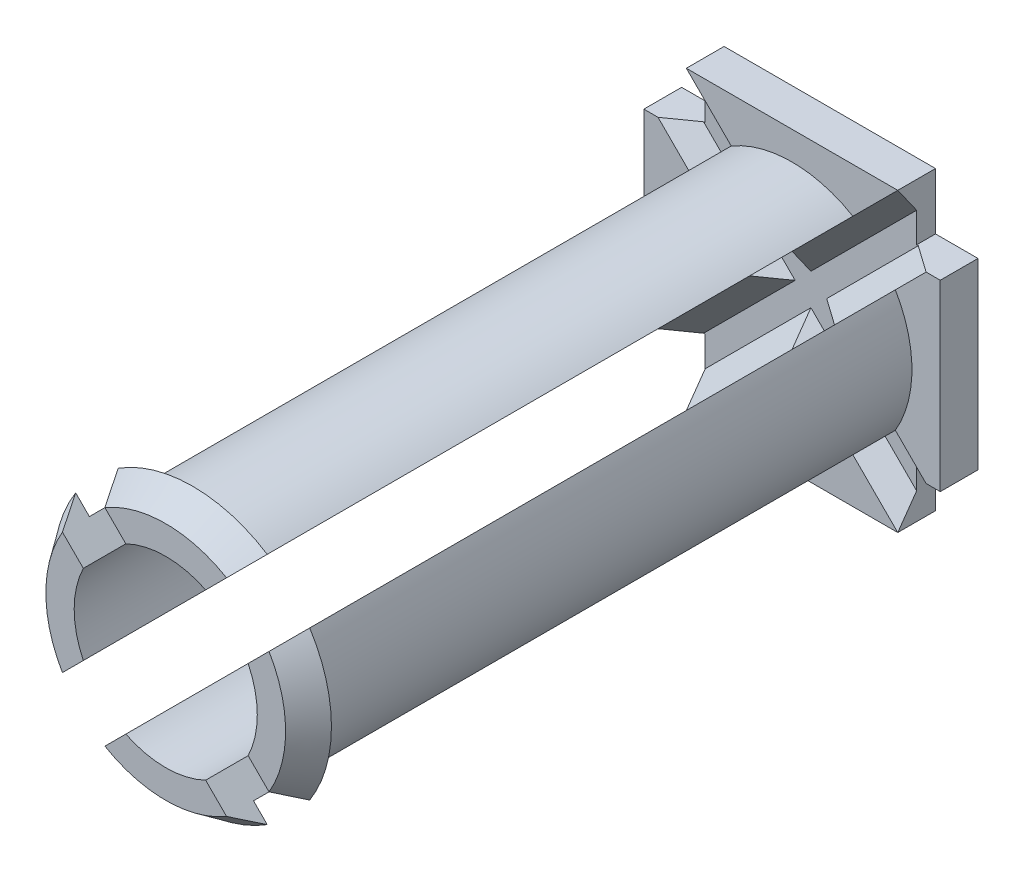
ISO-10303-21;
HEADER;
FILE_DESCRIPTION(('STEP AP214'),'2;1');
FILE_NAME('part.step','',(''),(''),'','','');
FILE_SCHEMA(('AUTOMOTIVE_DESIGN { 1 0 10303 214 1 1 1 1 }'));
ENDSEC;
DATA;
#1=APPLICATION_CONTEXT('core data for automotive mechanical design processes');
#2=APPLICATION_PROTOCOL_DEFINITION('international standard','automotive_design',2000,#1);
#3=PRODUCT_CONTEXT('',#1,'mechanical');
#4=PRODUCT('Part','Part','',(#3));
#5=PRODUCT_RELATED_PRODUCT_CATEGORY('part','',(#4));
#6=PRODUCT_DEFINITION_FORMATION('','',#4);
#7=PRODUCT_DEFINITION_CONTEXT('part definition',#1,'design');
#8=PRODUCT_DEFINITION('design','',#6,#7);
#9=PRODUCT_DEFINITION_SHAPE('','',#8);
#10=(LENGTH_UNIT() NAMED_UNIT(*) SI_UNIT(.MILLI.,.METRE.));
#11=(NAMED_UNIT(*) PLANE_ANGLE_UNIT() SI_UNIT($,.RADIAN.));
#12=(NAMED_UNIT(*) SI_UNIT($,.STERADIAN.) SOLID_ANGLE_UNIT());
#13=UNCERTAINTY_MEASURE_WITH_UNIT(LENGTH_MEASURE(1.E-05),#10,'distance_accuracy_value','');
#14=(GEOMETRIC_REPRESENTATION_CONTEXT(3) GLOBAL_UNCERTAINTY_ASSIGNED_CONTEXT((#13)) GLOBAL_UNIT_ASSIGNED_CONTEXT((#10,
#11,#12)) REPRESENTATION_CONTEXT('',''));
#15=CARTESIAN_POINT('',(0.,0.,0.));
#16=DIRECTION('',(0.,0.,1.));
#17=DIRECTION('',(1.,0.,0.));
#18=AXIS2_PLACEMENT_3D('',#15,#16,#17);
#19=CARTESIAN_POINT('',(-13.7,-15.7,2.));
#20=DIRECTION('',(0.,1.,0.));
#21=DIRECTION('',(0.,0.,1.));
#22=AXIS2_PLACEMENT_3D('',#19,#20,#21);
#23=PLANE('',#22);
#24=DIRECTION('',(1.,0.,0.));
#25=VECTOR('',#24,1.);
#26=CARTESIAN_POINT('',(-13.7,-15.7,-2.));
#27=LINE('',#26,#25);
#28=CARTESIAN_POINT('',(-11.2000000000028,-15.7000000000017,-2.));
#29=VERTEX_POINT('',#28);
#30=CARTESIAN_POINT('',(11.2000000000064,-15.7000000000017,-2.));
#31=VERTEX_POINT('',#30);
#32=EDGE_CURVE('E544',#29,#31,#27,.T.);
#33=ORIENTED_EDGE('',*,*,#32,.T.);
#34=DIRECTION('',(0.,0.,1.));
#35=VECTOR('',#34,1.);
#36=CARTESIAN_POINT('',(11.2000000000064,-15.7000000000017,-2.));
#37=LINE('',#36,#35);
#38=CARTESIAN_POINT('',(11.2000000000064,-15.7000000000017,2.));
#39=VERTEX_POINT('',#38);
#40=EDGE_CURVE('E62',#31,#39,#37,.T.);
#41=ORIENTED_EDGE('',*,*,#40,.T.);
#42=DIRECTION('',(1.,0.,0.));
#43=VECTOR('',#42,1.);
#44=CARTESIAN_POINT('',(-13.7,-15.7,2.));
#45=LINE('',#44,#43);
#46=CARTESIAN_POINT('',(-11.2000000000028,-15.7000000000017,2.));
#47=VERTEX_POINT('',#46);
#48=EDGE_CURVE('E532',#47,#39,#45,.T.);
#49=ORIENTED_EDGE('',*,*,#48,.F.);
#50=DIRECTION('',(0.,0.,1.));
#51=VECTOR('',#50,1.);
#52=CARTESIAN_POINT('',(-11.2000000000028,-15.7000000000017,-2.));
#53=LINE('',#52,#51);
#54=EDGE_CURVE('E291',#29,#47,#53,.T.);
#55=ORIENTED_EDGE('',*,*,#54,.F.);
#56=EDGE_LOOP('',(#33,#41,#49,#55));
#57=FACE_BOUND('',#56,.T.);
#58=ADVANCED_FACE('F36',(#57),#23,.F.);
#59=CARTESIAN_POINT('',(15.7,13.7,2.));
#60=DIRECTION('',(-1.,0.,0.));
#61=DIRECTION('',(0.,-1.,0.));
#62=AXIS2_PLACEMENT_3D('',#59,#60,#61);
#63=PLANE('',#62);
#64=DIRECTION('',(0.,0.,-1.));
#65=VECTOR('',#64,1.);
#66=CARTESIAN_POINT('',(15.7,-9.7,68.3562960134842));
#67=LINE('',#66,#65);
#68=CARTESIAN_POINT('',(15.7,-9.7,2.));
#69=VERTEX_POINT('',#68);
#70=CARTESIAN_POINT('',(15.7,-9.7,-2.));
#71=VERTEX_POINT('',#70);
#72=EDGE_CURVE('E330',#69,#71,#67,.T.);
#73=ORIENTED_EDGE('',*,*,#72,.T.);
#74=DIRECTION('',(0.,1.,0.));
#75=VECTOR('',#74,1.);
#76=CARTESIAN_POINT('',(15.7,13.7,-2.));
#77=LINE('',#76,#75);
#78=CARTESIAN_POINT('',(15.7000000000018,9.70000000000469,-2.));
#79=VERTEX_POINT('',#78);
#80=EDGE_CURVE('E546',#71,#79,#77,.T.);
#81=ORIENTED_EDGE('',*,*,#80,.T.);
#82=DIRECTION('',(0.,0.,-1.));
#83=VECTOR('',#82,1.);
#84=CARTESIAN_POINT('',(15.7000000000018,9.70000000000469,68.3562960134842));
#85=LINE('',#84,#83);
#86=CARTESIAN_POINT('',(15.7000000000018,9.70000000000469,2.));
#87=VERTEX_POINT('',#86);
#88=EDGE_CURVE('E327',#87,#79,#85,.T.);
#89=ORIENTED_EDGE('',*,*,#88,.F.);
#90=DIRECTION('',(0.,1.,0.));
#91=VECTOR('',#90,1.);
#92=CARTESIAN_POINT('',(15.7,13.7,2.));
#93=LINE('',#92,#91);
#94=EDGE_CURVE('E534',#69,#87,#93,.T.);
#95=ORIENTED_EDGE('',*,*,#94,.F.);
#96=EDGE_LOOP('',(#73,#81,#89,#95));
#97=FACE_BOUND('',#96,.T.);
#98=ADVANCED_FACE('F718',(#97),#63,.F.);
#99=CARTESIAN_POINT('',(-13.7,15.7,2.));
#100=DIRECTION('',(0.,-1.,0.));
#101=DIRECTION('',(0.,0.,-1.));
#102=AXIS2_PLACEMENT_3D('',#99,#100,#101);
#103=PLANE('',#102);
#104=DIRECTION('',(-1.,0.,0.));
#105=VECTOR('',#104,1.);
#106=CARTESIAN_POINT('',(-13.7,15.7,2.));
#107=LINE('',#106,#105);
#108=CARTESIAN_POINT('',(11.2000000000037,15.7,2.));
#109=VERTEX_POINT('',#108);
#110=CARTESIAN_POINT('',(-11.2,15.7,2.));
#111=VERTEX_POINT('',#110);
#112=EDGE_CURVE('E538',#109,#111,#107,.T.);
#113=ORIENTED_EDGE('',*,*,#112,.F.);
#114=DIRECTION('',(0.,0.,1.));
#115=VECTOR('',#114,1.);
#116=CARTESIAN_POINT('',(11.2000000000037,15.7,-2.));
#117=LINE('',#116,#115);
#118=CARTESIAN_POINT('',(11.2000000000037,15.7,-2.));
#119=VERTEX_POINT('',#118);
#120=EDGE_CURVE('E77',#119,#109,#117,.T.);
#121=ORIENTED_EDGE('',*,*,#120,.F.);
#122=DIRECTION('',(-1.,0.,0.));
#123=VECTOR('',#122,1.);
#124=CARTESIAN_POINT('',(-13.7,15.7,-2.));
#125=LINE('',#124,#123);
#126=CARTESIAN_POINT('',(-11.2,15.7,-2.));
#127=VERTEX_POINT('',#126);
#128=EDGE_CURVE('E549',#119,#127,#125,.T.);
#129=ORIENTED_EDGE('',*,*,#128,.T.);
#130=DIRECTION('',(0.,0.,1.));
#131=VECTOR('',#130,1.);
#132=CARTESIAN_POINT('',(-11.2,15.7,-2.));
#133=LINE('',#132,#131);
#134=EDGE_CURVE('E53',#127,#111,#133,.T.);
#135=ORIENTED_EDGE('',*,*,#134,.T.);
#136=EDGE_LOOP('',(#113,#121,#129,#135));
#137=FACE_BOUND('',#136,.T.);
#138=ADVANCED_FACE('F723',(#137),#103,.F.);
#139=CARTESIAN_POINT('',(-15.7,13.7,2.));
#140=DIRECTION('',(1.,0.,0.));
#141=DIRECTION('',(0.,1.,0.));
#142=AXIS2_PLACEMENT_3D('',#139,#140,#141);
#143=PLANE('',#142);
#144=DIRECTION('',(0.,-1.,0.));
#145=VECTOR('',#144,1.);
#146=CARTESIAN_POINT('',(-15.7,13.7,-2.));
#147=LINE('',#146,#145);
#148=CARTESIAN_POINT('',(-15.6999999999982,9.70000000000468,-2.));
#149=VERTEX_POINT('',#148);
#150=CARTESIAN_POINT('',(-15.7,-9.7,-2.));
#151=VERTEX_POINT('',#150);
#152=EDGE_CURVE('E535',#149,#151,#147,.T.);
#153=ORIENTED_EDGE('',*,*,#152,.T.);
#154=DIRECTION('',(0.,0.,-1.));
#155=VECTOR('',#154,1.);
#156=CARTESIAN_POINT('',(-15.7,-9.7,68.3562960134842));
#157=LINE('',#156,#155);
#158=CARTESIAN_POINT('',(-15.7,-9.7,2.));
#159=VERTEX_POINT('',#158);
#160=EDGE_CURVE('E333',#159,#151,#157,.T.);
#161=ORIENTED_EDGE('',*,*,#160,.F.);
#162=DIRECTION('',(0.,-1.,0.));
#163=VECTOR('',#162,1.);
#164=CARTESIAN_POINT('',(-15.7,13.7,2.));
#165=LINE('',#164,#163);
#166=CARTESIAN_POINT('',(-15.6999999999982,9.70000000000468,2.));
#167=VERTEX_POINT('',#166);
#168=EDGE_CURVE('E540',#167,#159,#165,.T.);
#169=ORIENTED_EDGE('',*,*,#168,.F.);
#170=DIRECTION('',(0.,0.,-1.));
#171=VECTOR('',#170,1.);
#172=CARTESIAN_POINT('',(-15.6999999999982,9.70000000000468,68.3562960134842));
#173=LINE('',#172,#171);
#174=EDGE_CURVE('E335',#167,#149,#173,.T.);
#175=ORIENTED_EDGE('',*,*,#174,.T.);
#176=EDGE_LOOP('',(#153,#161,#169,#175));
#177=FACE_BOUND('',#176,.T.);
#178=ADVANCED_FACE('F1045',(#177),#143,.F.);
#179=CARTESIAN_POINT('',(-13.7,-13.7,2.));
#180=DIRECTION('',(0.,0.,1.));
#181=DIRECTION('',(1.,0.,0.));
#182=AXIS2_PLACEMENT_3D('',#179,#180,#181);
#183=PLANE('',#182);
#184=CARTESIAN_POINT('',(0.,0.,2.));
#185=DIRECTION('',(0.,0.,1.));
#186=DIRECTION('',(1.,0.,0.));
#187=AXIS2_PLACEMENT_3D('',#184,#185,#186);
#188=CIRCLE('',#187,12.7);
#189=CARTESIAN_POINT('',(6.44381964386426,10.9438196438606,2.));
#190=VERTEX_POINT('',#189);
#191=CARTESIAN_POINT('',(-6.44381964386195,10.9438196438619,2.));
#192=VERTEX_POINT('',#191);
#193=EDGE_CURVE('E556',#190,#192,#188,.T.);
#194=ORIENTED_EDGE('',*,*,#193,.F.);
#195=DIRECTION('',(0.707106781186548,0.707106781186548,0.));
#196=VECTOR('',#195,1.);
#197=CARTESIAN_POINT('',(-15.9499999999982,-11.4500000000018,2.));
#198=LINE('',#197,#196);
#199=EDGE_CURVE('E508',#190,#109,#198,.T.);
#200=ORIENTED_EDGE('',*,*,#199,.T.);
#201=ORIENTED_EDGE('',*,*,#112,.T.);
#202=DIRECTION('',(0.707106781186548,-0.707106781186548,0.));
#203=VECTOR('',#202,1.);
#204=CARTESIAN_POINT('',(2.25,2.25,2.));
#205=LINE('',#204,#203);
#206=EDGE_CURVE('E487',#111,#192,#205,.T.);
#207=ORIENTED_EDGE('',*,*,#206,.T.);
#208=EDGE_LOOP('',(#194,#200,#201,#207));
#209=FACE_BOUND('',#208,.T.);
#210=ADVANCED_FACE('F647',(#209),#183,.T.);
#211=DIRECTION('',(-0.707106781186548,0.707106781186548,0.));
#212=VECTOR('',#211,1.);
#213=CARTESIAN_POINT('',(-2.24999999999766,-2.24999999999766,2.));
#214=LINE('',#213,#212);
#215=CARTESIAN_POINT('',(-10.9438196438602,6.4438196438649,2.));
#216=VERTEX_POINT('',#215);
#217=CARTESIAN_POINT('',(-14.2,9.70000000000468,2.));
#218=VERTEX_POINT('',#217);
#219=EDGE_CURVE('E467',#216,#218,#214,.T.);
#220=ORIENTED_EDGE('',*,*,#219,.T.);
#221=DIRECTION('',(-1.,0.,0.));
#222=VECTOR('',#221,1.);
#223=CARTESIAN_POINT('',(-13.7,9.70000000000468,2.));
#224=LINE('',#223,#222);
#225=EDGE_CURVE('E589',#218,#167,#224,.T.);
#226=ORIENTED_EDGE('',*,*,#225,.T.);
#227=ORIENTED_EDGE('',*,*,#168,.T.);
#228=DIRECTION('',(1.,0.,0.));
#229=VECTOR('',#228,1.);
#230=CARTESIAN_POINT('',(-13.7,-9.7,2.));
#231=LINE('',#230,#229);
#232=CARTESIAN_POINT('',(-14.2,-9.7,2.));
#233=VERTEX_POINT('',#232);
#234=EDGE_CURVE('E587',#159,#233,#231,.T.);
#235=ORIENTED_EDGE('',*,*,#234,.T.);
#236=DIRECTION('',(0.707106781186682,0.707106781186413,0.));
#237=VECTOR('',#236,1.);
#238=CARTESIAN_POINT('',(-15.9499999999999,-11.4499999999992,2.));
#239=LINE('',#238,#237);
#240=CARTESIAN_POINT('',(-10.9438196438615,-6.44381964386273,2.));
#241=VERTEX_POINT('',#240);
#242=EDGE_CURVE('E445',#233,#241,#239,.T.);
#243=ORIENTED_EDGE('',*,*,#242,.T.);
#244=EDGE_CURVE('E648',#216,#241,#188,.T.);
#245=ORIENTED_EDGE('',*,*,#244,.F.);
#246=EDGE_LOOP('',(#220,#226,#227,#235,#243,#245));
#247=FACE_BOUND('',#246,.T.);
#248=ADVANCED_FACE('F1033',(#247),#183,.T.);
#249=CARTESIAN_POINT('',(-6.44381964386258,-10.9438196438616,2.));
#250=VERTEX_POINT('',#249);
#251=CARTESIAN_POINT('',(6.4438196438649,-10.9438196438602,2.));
#252=VERTEX_POINT('',#251);
#253=EDGE_CURVE('E555',#250,#252,#188,.T.);
#254=ORIENTED_EDGE('',*,*,#253,.F.);
#255=DIRECTION('',(-0.707106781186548,-0.707106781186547,0.));
#256=VECTOR('',#255,1.);
#257=CARTESIAN_POINT('',(-11.4500000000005,-15.9499999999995,2.));
#258=LINE('',#257,#256);
#259=EDGE_CURVE('E425',#250,#47,#258,.T.);
#260=ORIENTED_EDGE('',*,*,#259,.T.);
#261=ORIENTED_EDGE('',*,*,#48,.T.);
#262=DIRECTION('',(-0.707106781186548,0.707106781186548,0.));
#263=VECTOR('',#262,1.);
#264=CARTESIAN_POINT('',(-2.24999999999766,-2.24999999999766,2.));
#265=LINE('',#264,#263);
#266=EDGE_CURVE('E404',#39,#252,#265,.T.);
#267=ORIENTED_EDGE('',*,*,#266,.T.);
#268=EDGE_LOOP('',(#254,#260,#261,#267));
#269=FACE_BOUND('',#268,.T.);
#270=ADVANCED_FACE('F715',(#269),#183,.T.);
#271=DIRECTION('',(0.707106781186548,-0.707106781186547,0.));
#272=VECTOR('',#271,1.);
#273=CARTESIAN_POINT('',(2.24999999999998,2.25,2.));
#274=LINE('',#273,#272);
#275=CARTESIAN_POINT('',(10.9438196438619,-6.44381964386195,2.));
#276=VERTEX_POINT('',#275);
#277=CARTESIAN_POINT('',(14.2,-9.7,2.));
#278=VERTEX_POINT('',#277);
#279=EDGE_CURVE('E384',#276,#278,#274,.T.);
#280=ORIENTED_EDGE('',*,*,#279,.T.);
#281=DIRECTION('',(1.,0.,0.));
#282=VECTOR('',#281,1.);
#283=CARTESIAN_POINT('',(-13.7,-9.70000000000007,2.));
#284=LINE('',#283,#282);
#285=EDGE_CURVE('E584',#278,#69,#284,.T.);
#286=ORIENTED_EDGE('',*,*,#285,.T.);
#287=ORIENTED_EDGE('',*,*,#94,.T.);
#288=DIRECTION('',(-1.,0.,0.));
#289=VECTOR('',#288,1.);
#290=CARTESIAN_POINT('',(-13.7,9.70000000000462,2.));
#291=LINE('',#290,#289);
#292=CARTESIAN_POINT('',(14.2000000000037,9.70000000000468,2.));
#293=VERTEX_POINT('',#292);
#294=EDGE_CURVE('E581',#87,#293,#291,.T.);
#295=ORIENTED_EDGE('',*,*,#294,.T.);
#296=DIRECTION('',(-0.707106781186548,-0.707106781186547,0.));
#297=VECTOR('',#296,1.);
#298=CARTESIAN_POINT('',(-11.4500000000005,-15.9499999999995,2.));
#299=LINE('',#298,#297);
#300=CARTESIAN_POINT('',(10.9438196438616,6.44381964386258,2.));
#301=VERTEX_POINT('',#300);
#302=EDGE_CURVE('E355',#293,#301,#299,.T.);
#303=ORIENTED_EDGE('',*,*,#302,.T.);
#304=EDGE_CURVE('E543',#276,#301,#188,.T.);
#305=ORIENTED_EDGE('',*,*,#304,.F.);
#306=EDGE_LOOP('',(#280,#286,#287,#295,#303,#305));
#307=FACE_BOUND('',#306,.T.);
#308=ADVANCED_FACE('F892',(#307),#183,.T.);
#309=CARTESIAN_POINT('',(0.,0.,0.));
#310=DIRECTION('',(0.,0.,-1.));
#311=DIRECTION('',(-1.,0.,0.));
#312=AXIS2_PLACEMENT_3D('',#309,#310,#311);
#313=CYLINDRICAL_SURFACE('',#312,9.69999999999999);
#314=CARTESIAN_POINT('',(0.,0.,2.));
#315=DIRECTION('',(0.,0.,1.));
#316=DIRECTION('',(1.,0.,0.));
#317=AXIS2_PLACEMENT_3D('',#314,#315,#316);
#318=CIRCLE('',#317,9.69999999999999);
#319=CARTESIAN_POINT('',(-4.2293904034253,8.7293904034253,2.));
#320=VERTEX_POINT('',#319);
#321=CARTESIAN_POINT('',(4.22939040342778,8.7293904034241,2.));
#322=VERTEX_POINT('',#321);
#323=EDGE_CURVE('E560',#320,#322,#318,.F.);
#324=ORIENTED_EDGE('',*,*,#323,.T.);
#325=DIRECTION('',(0.,0.,-1.));
#326=VECTOR('',#325,1.);
#327=CARTESIAN_POINT('',(4.22939040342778,8.7293904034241,0.));
#328=LINE('',#327,#326);
#329=CARTESIAN_POINT('',(4.22939040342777,8.72939040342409,68.3562960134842));
#330=VERTEX_POINT('',#329);
#331=EDGE_CURVE('E629',#322,#330,#328,.F.);
#332=ORIENTED_EDGE('',*,*,#331,.T.);
#333=CARTESIAN_POINT('',(0.,0.,68.3562960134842));
#334=DIRECTION('',(0.,0.,-1.));
#335=DIRECTION('',(-1.,0.,0.));
#336=AXIS2_PLACEMENT_3D('',#333,#334,#335);
#337=CIRCLE('',#336,9.69999999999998);
#338=CARTESIAN_POINT('',(-4.22939040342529,8.72939040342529,68.3562960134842));
#339=VERTEX_POINT('',#338);
#340=EDGE_CURVE('E531',#339,#330,#337,.T.);
#341=ORIENTED_EDGE('',*,*,#340,.F.);
#342=DIRECTION('',(0.,0.,-1.));
#343=VECTOR('',#342,1.);
#344=CARTESIAN_POINT('',(-4.2293904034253,8.7293904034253,0.));
#345=LINE('',#344,#343);
#346=EDGE_CURVE('E472',#339,#320,#345,.T.);
#347=ORIENTED_EDGE('',*,*,#346,.T.);
#348=EDGE_LOOP('',(#324,#332,#341,#347));
#349=FACE_BOUND('',#348,.T.);
#350=ADVANCED_FACE('F627',(#349),#313,.F.);
#351=CARTESIAN_POINT('',(-8.72939040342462,-4.2293904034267,2.));
#352=VERTEX_POINT('',#351);
#353=CARTESIAN_POINT('',(-8.72939040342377,4.22939040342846,2.));
#354=VERTEX_POINT('',#353);
#355=EDGE_CURVE('E612',#352,#354,#318,.F.);
#356=ORIENTED_EDGE('',*,*,#355,.T.);
#357=DIRECTION('',(0.,0.,-1.));
#358=VECTOR('',#357,1.);
#359=CARTESIAN_POINT('',(-8.72939040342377,4.22939040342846,0.));
#360=LINE('',#359,#358);
#361=CARTESIAN_POINT('',(-8.72939040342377,4.22939040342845,68.3562960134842));
#362=VERTEX_POINT('',#361);
#363=EDGE_CURVE('E621',#354,#362,#360,.F.);
#364=ORIENTED_EDGE('',*,*,#363,.T.);
#365=CARTESIAN_POINT('',(-8.72939040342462,-4.22939040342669,68.3562960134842));
#366=VERTEX_POINT('',#365);
#367=EDGE_CURVE('E527',#366,#362,#337,.T.);
#368=ORIENTED_EDGE('',*,*,#367,.F.);
#369=DIRECTION('',(0.,0.,-1.));
#370=VECTOR('',#369,1.);
#371=CARTESIAN_POINT('',(-8.72939040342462,-4.2293904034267,0.));
#372=LINE('',#371,#370);
#373=EDGE_CURVE('E430',#366,#352,#372,.T.);
#374=ORIENTED_EDGE('',*,*,#373,.T.);
#375=EDGE_LOOP('',(#356,#364,#368,#374));
#376=FACE_BOUND('',#375,.T.);
#377=ADVANCED_FACE('F618',(#376),#313,.F.);
#378=CARTESIAN_POINT('',(4.22939040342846,-8.72939040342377,2.));
#379=VERTEX_POINT('',#378);
#380=CARTESIAN_POINT('',(-4.22939040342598,-8.72939040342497,2.));
#381=VERTEX_POINT('',#380);
#382=EDGE_CURVE('E561',#379,#381,#318,.F.);
#383=ORIENTED_EDGE('',*,*,#382,.T.);
#384=DIRECTION('',(0.,0.,-1.));
#385=VECTOR('',#384,1.);
#386=CARTESIAN_POINT('',(-4.22939040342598,-8.72939040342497,0.));
#387=LINE('',#386,#385);
#388=CARTESIAN_POINT('',(-4.22939040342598,-8.72939040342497,68.3562960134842));
#389=VERTEX_POINT('',#388);
#390=EDGE_CURVE('E1384',#381,#389,#387,.F.);
#391=ORIENTED_EDGE('',*,*,#390,.T.);
#392=CARTESIAN_POINT('',(4.22939040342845,-8.72939040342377,68.3562960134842));
#393=VERTEX_POINT('',#392);
#394=EDGE_CURVE('E530',#393,#389,#337,.T.);
#395=ORIENTED_EDGE('',*,*,#394,.F.);
#396=DIRECTION('',(0.,0.,-1.));
#397=VECTOR('',#396,1.);
#398=CARTESIAN_POINT('',(4.22939040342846,-8.72939040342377,0.));
#399=LINE('',#398,#397);
#400=EDGE_CURVE('E389',#393,#379,#399,.T.);
#401=ORIENTED_EDGE('',*,*,#400,.T.);
#402=EDGE_LOOP('',(#383,#391,#395,#401));
#403=FACE_BOUND('',#402,.T.);
#404=ADVANCED_FACE('F689',(#403),#313,.F.);
#405=CARTESIAN_POINT('',(8.72939040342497,4.22939040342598,2.));
#406=VERTEX_POINT('',#405);
#407=CARTESIAN_POINT('',(8.7293904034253,-4.2293904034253,2.));
#408=VERTEX_POINT('',#407);
#409=EDGE_CURVE('E557',#406,#408,#318,.F.);
#410=ORIENTED_EDGE('',*,*,#409,.T.);
#411=DIRECTION('',(0.,0.,-1.));
#412=VECTOR('',#411,1.);
#413=CARTESIAN_POINT('',(8.7293904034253,-4.2293904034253,0.));
#414=LINE('',#413,#412);
#415=CARTESIAN_POINT('',(8.7293904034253,-4.2293904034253,68.3562960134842));
#416=VERTEX_POINT('',#415);
#417=EDGE_CURVE('E1344',#408,#416,#414,.F.);
#418=ORIENTED_EDGE('',*,*,#417,.T.);
#419=CARTESIAN_POINT('',(8.72939040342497,4.22939040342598,68.3562960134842));
#420=VERTEX_POINT('',#419);
#421=EDGE_CURVE('E1335',#420,#416,#337,.T.);
#422=ORIENTED_EDGE('',*,*,#421,.F.);
#423=DIRECTION('',(0.,0.,-1.));
#424=VECTOR('',#423,1.);
#425=CARTESIAN_POINT('',(8.72939040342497,4.22939040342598,0.));
#426=LINE('',#425,#424);
#427=EDGE_CURVE('E338',#420,#406,#426,.T.);
#428=ORIENTED_EDGE('',*,*,#427,.T.);
#429=EDGE_LOOP('',(#410,#418,#422,#428));
#430=FACE_BOUND('',#429,.T.);
#431=ADVANCED_FACE('F999',(#430),#313,.F.);
#432=CARTESIAN_POINT('',(0.,9.69999999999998,68.3562960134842));
#433=DIRECTION('',(0.,0.,1.));
#434=DIRECTION('',(1.,0.,0.));
#435=AXIS2_PLACEMENT_3D('',#432,#433,#434);
#436=PLANE('',#435);
#437=ORIENTED_EDGE('',*,*,#340,.T.);
#438=DIRECTION('',(-0.707106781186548,-0.707106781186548,0.));
#439=VECTOR('',#438,1.);
#440=CARTESIAN_POINT('',(11.2000000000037,15.7,68.3562960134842));
#441=LINE('',#440,#439);
#442=CARTESIAN_POINT('',(6.44381964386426,10.9438196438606,68.3562960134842));
#443=VERTEX_POINT('',#442);
#444=EDGE_CURVE('E88',#443,#330,#441,.T.);
#445=ORIENTED_EDGE('',*,*,#444,.F.);
#446=CARTESIAN_POINT('',(0.,0.,68.3562960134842));
#447=DIRECTION('',(0.,0.,-1.));
#448=DIRECTION('',(-1.,0.,0.));
#449=AXIS2_PLACEMENT_3D('',#446,#447,#448);
#450=CIRCLE('',#449,12.7);
#451=CARTESIAN_POINT('',(-6.44381964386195,10.9438196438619,68.3562960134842));
#452=VERTEX_POINT('',#451);
#453=EDGE_CURVE('E526',#452,#443,#450,.T.);
#454=ORIENTED_EDGE('',*,*,#453,.F.);
#455=DIRECTION('',(-0.707106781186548,0.707106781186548,0.));
#456=VECTOR('',#455,1.);
#457=CARTESIAN_POINT('',(-11.2,15.7,68.3562960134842));
#458=LINE('',#457,#456);
#459=EDGE_CURVE('E306',#339,#452,#458,.T.);
#460=ORIENTED_EDGE('',*,*,#459,.F.);
#461=EDGE_LOOP('',(#437,#445,#454,#460));
#462=FACE_BOUND('',#461,.T.);
#463=ADVANCED_FACE('F980',(#462),#436,.T.);
#464=ORIENTED_EDGE('',*,*,#367,.T.);
#465=DIRECTION('',(0.707106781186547,-0.707106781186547,0.));
#466=VECTOR('',#465,1.);
#467=CARTESIAN_POINT('',(-14.2,9.70000000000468,68.3562960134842));
#468=LINE('',#467,#466);
#469=CARTESIAN_POINT('',(-10.9438196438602,6.4438196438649,68.3562960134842));
#470=VERTEX_POINT('',#469);
#471=EDGE_CURVE('E309',#470,#362,#468,.T.);
#472=ORIENTED_EDGE('',*,*,#471,.F.);
#473=CARTESIAN_POINT('',(-10.9438196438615,-6.44381964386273,68.3562960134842));
#474=VERTEX_POINT('',#473);
#475=EDGE_CURVE('E522',#474,#470,#450,.T.);
#476=ORIENTED_EDGE('',*,*,#475,.F.);
#477=DIRECTION('',(-0.707106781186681,-0.707106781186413,0.));
#478=VECTOR('',#477,1.);
#479=CARTESIAN_POINT('',(-4.49999999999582,5.03069808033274E-13,68.3562960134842));
#480=LINE('',#479,#478);
#481=EDGE_CURVE('E312',#366,#474,#480,.T.);
#482=ORIENTED_EDGE('',*,*,#481,.F.);
#483=EDGE_LOOP('',(#464,#472,#476,#482));
#484=FACE_BOUND('',#483,.T.);
#485=ADVANCED_FACE('F986',(#484),#436,.T.);
#486=ORIENTED_EDGE('',*,*,#394,.T.);
#487=DIRECTION('',(0.707106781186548,0.707106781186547,0.));
#488=VECTOR('',#487,1.);
#489=CARTESIAN_POINT('',(1.83880688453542E-12,-4.49999999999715,68.3562960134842));
#490=LINE('',#489,#488);
#491=CARTESIAN_POINT('',(-6.44381964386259,-10.9438196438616,68.3562960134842));
#492=VERTEX_POINT('',#491);
#493=EDGE_CURVE('E315',#492,#389,#490,.T.);
#494=ORIENTED_EDGE('',*,*,#493,.F.);
#495=CARTESIAN_POINT('',(6.4438196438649,-10.9438196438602,68.3562960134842));
#496=VERTEX_POINT('',#495);
#497=EDGE_CURVE('E525',#496,#492,#450,.T.);
#498=ORIENTED_EDGE('',*,*,#497,.F.);
#499=DIRECTION('',(0.707106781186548,-0.707106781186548,0.));
#500=VECTOR('',#499,1.);
#501=CARTESIAN_POINT('',(1.83880688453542E-12,-4.49999999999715,68.3562960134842));
#502=LINE('',#501,#500);
#503=EDGE_CURVE('E318',#393,#496,#502,.T.);
#504=ORIENTED_EDGE('',*,*,#503,.F.);
#505=EDGE_LOOP('',(#486,#494,#498,#504));
#506=FACE_BOUND('',#505,.T.);
#507=ADVANCED_FACE('F978',(#506),#436,.T.);
#508=ORIENTED_EDGE('',*,*,#421,.T.);
#509=DIRECTION('',(-0.707106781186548,0.707106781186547,0.));
#510=VECTOR('',#509,1.);
#511=CARTESIAN_POINT('',(4.49999999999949,5.03069808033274E-13,68.3562960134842));
#512=LINE('',#511,#510);
#513=CARTESIAN_POINT('',(10.9438196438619,-6.44381964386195,68.3562960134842));
#514=VERTEX_POINT('',#513);
#515=EDGE_CURVE('E321',#514,#416,#512,.T.);
#516=ORIENTED_EDGE('',*,*,#515,.F.);
#517=CARTESIAN_POINT('',(10.9438196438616,6.44381964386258,68.3562960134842));
#518=VERTEX_POINT('',#517);
#519=EDGE_CURVE('E1340',#518,#514,#450,.T.);
#520=ORIENTED_EDGE('',*,*,#519,.F.);
#521=DIRECTION('',(0.707106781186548,0.707106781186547,0.));
#522=VECTOR('',#521,1.);
#523=CARTESIAN_POINT('',(14.2000000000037,9.70000000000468,68.3562960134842));
#524=LINE('',#523,#522);
#525=EDGE_CURVE('E324',#420,#518,#524,.T.);
#526=ORIENTED_EDGE('',*,*,#525,.F.);
#527=EDGE_LOOP('',(#508,#516,#520,#526));
#528=FACE_BOUND('',#527,.T.);
#529=ADVANCED_FACE('F971',(#528),#436,.T.);
#530=CARTESIAN_POINT('',(0.,0.,65.5));
#531=DIRECTION('',(0.,0.,-1.));
#532=DIRECTION('',(-1.,0.,0.));
#533=AXIS2_PLACEMENT_3D('',#530,#531,#532);
#534=CONICAL_SURFACE('',#533,14.7,0.610865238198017);
#535=ORIENTED_EDGE('',*,*,#453,.T.);
#536=CARTESIAN_POINT('',(6.4437173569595,10.9437173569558,68.3564960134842));
#537=CARTESIAN_POINT('',(6.56527942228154,11.0652794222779,68.1188058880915));
#538=CARTESIAN_POINT('',(6.68673759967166,11.186737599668,67.8810095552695));
#539=CARTESIAN_POINT('',(6.92946709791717,11.4294670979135,67.4052265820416));
#540=CARTESIAN_POINT('',(7.05073841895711,11.5507384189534,67.1672399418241));
#541=CARTESIAN_POINT('',(7.29311533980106,11.7931153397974,66.6910980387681));
#542=CARTESIAN_POINT('',(7.4142209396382,11.9142209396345,66.4529427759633));
#543=CARTESIAN_POINT('',(7.65628332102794,12.1562833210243,65.9764806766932));
#544=CARTESIAN_POINT('',(7.77724010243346,12.2772401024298,65.7381738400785));
#545=CARTESIAN_POINT('',(7.89813079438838,12.3981307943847,65.4998));
#546=B_SPLINE_CURVE_WITH_KNOTS('',3,(#536,#537,#538,#539,#540,#541,#542,#543,#544,#545),
.UNSPECIFIED.,.F.,.F.,(4,2,2,2,4),(0.,0.880034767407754,1.76006866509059,2.64010238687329,
3.52013697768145),.UNSPECIFIED.);
#547=CARTESIAN_POINT('',(7.89802936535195,12.3980293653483,65.5));
#548=VERTEX_POINT('',#547);
#549=EDGE_CURVE('E501',#443,#548,#546,.T.);
#550=ORIENTED_EDGE('',*,*,#549,.T.);
#551=CARTESIAN_POINT('',(0.,0.,65.5));
#552=DIRECTION('',(0.,0.,-1.));
#553=DIRECTION('',(-1.,0.,0.));
#554=AXIS2_PLACEMENT_3D('',#551,#552,#553);
#555=CIRCLE('',#554,14.7);
#556=CARTESIAN_POINT('',(-7.8980293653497,12.3980293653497,65.5));
#557=VERTEX_POINT('',#556);
#558=EDGE_CURVE('E521',#557,#548,#555,.T.);
#559=ORIENTED_EDGE('',*,*,#558,.F.);
#560=CARTESIAN_POINT('',(-7.89813079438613,12.3981307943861,65.4998));
#561=CARTESIAN_POINT('',(-7.77724010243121,12.2772401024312,65.7381738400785));
#562=CARTESIAN_POINT('',(-7.65628332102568,12.1562833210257,65.9764806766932));
#563=CARTESIAN_POINT('',(-7.41422093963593,11.9142209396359,66.4529427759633));
#564=CARTESIAN_POINT('',(-7.29311533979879,11.7931153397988,66.6910980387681));
#565=CARTESIAN_POINT('',(-7.05073841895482,11.5507384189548,67.1672399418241));
#566=CARTESIAN_POINT('',(-6.92946709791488,11.4294670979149,67.4052265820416));
#567=CARTESIAN_POINT('',(-6.68673759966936,11.1867375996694,67.8810095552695));
#568=CARTESIAN_POINT('',(-6.56527942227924,11.0652794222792,68.1188058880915));
#569=CARTESIAN_POINT('',(-6.44371735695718,10.9437173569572,68.3564960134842));
#570=B_SPLINE_CURVE_WITH_KNOTS('',3,(#560,#561,#562,#563,#564,#565,#566,#567,#568,#569),
.UNSPECIFIED.,.F.,.F.,(4,2,2,2,4),(0.,0.880034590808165,1.76006831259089,2.64010221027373,
3.5201369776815),.UNSPECIFIED.);
#571=EDGE_CURVE('E481',#557,#452,#570,.T.);
#572=ORIENTED_EDGE('',*,*,#571,.T.);
#573=EDGE_LOOP('',(#535,#550,#559,#572));
#574=FACE_BOUND('',#573,.T.);
#575=ADVANCED_FACE('F357',(#574),#534,.T.);
#576=ORIENTED_EDGE('',*,*,#475,.T.);
#577=CARTESIAN_POINT('',(-10.9437173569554,6.44371735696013,68.3564960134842));
#578=CARTESIAN_POINT('',(-11.0652794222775,6.56527942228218,68.1188058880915));
#579=CARTESIAN_POINT('',(-11.1867375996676,6.68673759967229,67.8810095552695));
#580=CARTESIAN_POINT('',(-11.4294670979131,6.9294670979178,67.4052265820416));
#581=CARTESIAN_POINT('',(-11.550738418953,7.05073841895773,67.1672399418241));
#582=CARTESIAN_POINT('',(-11.793115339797,7.29311533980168,66.6910980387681));
#583=CARTESIAN_POINT('',(-11.9142209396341,7.41422093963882,66.4529427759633));
#584=CARTESIAN_POINT('',(-12.1562833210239,7.65628332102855,65.9764806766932));
#585=CARTESIAN_POINT('',(-12.2772401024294,7.77724010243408,65.7381738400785));
#586=CARTESIAN_POINT('',(-12.3981307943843,7.89813079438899,65.4998));
#587=B_SPLINE_CURVE_WITH_KNOTS('',3,(#577,#578,#579,#580,#581,#582,#583,#584,#585,#586),
.UNSPECIFIED.,.F.,.F.,(4,2,2,2,4),(0.,0.88003476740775,1.76006866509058,2.64010238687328,
3.52013697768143),.UNSPECIFIED.);
#588=CARTESIAN_POINT('',(-12.3980293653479,7.89802936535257,65.5));
#589=VERTEX_POINT('',#588);
#590=EDGE_CURVE('E460',#470,#589,#587,.T.);
#591=ORIENTED_EDGE('',*,*,#590,.T.);
#592=CARTESIAN_POINT('',(-12.3980293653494,-7.89802936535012,65.5));
#593=VERTEX_POINT('',#592);
#594=EDGE_CURVE('E517',#593,#589,#555,.T.);
#595=ORIENTED_EDGE('',*,*,#594,.F.);
#596=CARTESIAN_POINT('',(-12.3981307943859,-7.89813079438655,65.4998));
#597=CARTESIAN_POINT('',(-12.2772401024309,-7.77724010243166,65.7381738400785));
#598=CARTESIAN_POINT('',(-12.1562833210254,-7.65628332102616,65.9764806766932));
#599=CARTESIAN_POINT('',(-11.9142209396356,-7.41422093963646,66.4529427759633));
#600=CARTESIAN_POINT('',(-11.7931153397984,-7.29311533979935,66.6910980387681));
#601=CARTESIAN_POINT('',(-11.5507384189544,-7.05073841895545,67.1672399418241));
#602=CARTESIAN_POINT('',(-11.4294670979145,-6.92946709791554,67.4052265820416));
#603=CARTESIAN_POINT('',(-11.1867375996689,-6.68673759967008,67.8810095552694));
#604=CARTESIAN_POINT('',(-11.0652794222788,-6.56527942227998,68.1188058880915));
#605=CARTESIAN_POINT('',(-10.9437173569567,-6.44371735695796,68.3564960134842));
#606=B_SPLINE_CURVE_WITH_KNOTS('',3,(#596,#597,#598,#599,#600,#601,#602,#603,#604,#605),
.UNSPECIFIED.,.F.,.F.,(4,2,2,2,4),(0.,0.88003459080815,1.76006831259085,2.64010221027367,
3.52013697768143),.UNSPECIFIED.);
#607=EDGE_CURVE('E439',#593,#474,#606,.T.);
#608=ORIENTED_EDGE('',*,*,#607,.T.);
#609=EDGE_LOOP('',(#576,#591,#595,#608));
#610=FACE_BOUND('',#609,.T.);
#611=ADVANCED_FACE('F958',(#610),#534,.T.);
#612=ORIENTED_EDGE('',*,*,#497,.T.);
#613=CARTESIAN_POINT('',(-6.44371735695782,-10.9437173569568,68.3564960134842));
#614=CARTESIAN_POINT('',(-6.56527942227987,-11.0652794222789,68.1188058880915));
#615=CARTESIAN_POINT('',(-6.68673759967,-11.186737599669,67.8810095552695));
#616=CARTESIAN_POINT('',(-6.92946709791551,-11.4294670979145,67.4052265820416));
#617=CARTESIAN_POINT('',(-7.05073841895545,-11.5507384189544,67.1672399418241));
#618=CARTESIAN_POINT('',(-7.29311533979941,-11.7931153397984,66.6910980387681));
#619=CARTESIAN_POINT('',(-7.41422093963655,-11.9142209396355,66.4529427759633));
#620=CARTESIAN_POINT('',(-7.6562833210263,-12.1562833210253,65.9764806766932));
#621=CARTESIAN_POINT('',(-7.77724010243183,-12.2772401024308,65.7381738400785));
#622=CARTESIAN_POINT('',(-7.89813079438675,-12.3981307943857,65.4998));
#623=B_SPLINE_CURVE_WITH_KNOTS('',3,(#613,#614,#615,#616,#617,#618,#619,#620,#621,#622),
.UNSPECIFIED.,.F.,.F.,(4,2,2,2,4),(0.,0.880034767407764,1.76006866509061,2.64010238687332,
3.52013697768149),.UNSPECIFIED.);
#624=CARTESIAN_POINT('',(-7.89802936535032,-12.3980293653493,65.5));
#625=VERTEX_POINT('',#624);
#626=EDGE_CURVE('E418',#492,#625,#623,.T.);
#627=ORIENTED_EDGE('',*,*,#626,.T.);
#628=CARTESIAN_POINT('',(7.89802936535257,-12.3980293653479,65.5));
#629=VERTEX_POINT('',#628);
#630=EDGE_CURVE('E520',#629,#625,#555,.T.);
#631=ORIENTED_EDGE('',*,*,#630,.F.);
#632=CARTESIAN_POINT('',(7.89813079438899,-12.3981307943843,65.4998));
#633=CARTESIAN_POINT('',(7.77724010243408,-12.2772401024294,65.7381738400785));
#634=CARTESIAN_POINT('',(7.65628332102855,-12.1562833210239,65.9764806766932));
#635=CARTESIAN_POINT('',(7.41422093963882,-11.9142209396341,66.4529427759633));
#636=CARTESIAN_POINT('',(7.29311533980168,-11.793115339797,66.6910980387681));
#637=CARTESIAN_POINT('',(7.05073841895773,-11.550738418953,67.1672399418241));
#638=CARTESIAN_POINT('',(6.9294670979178,-11.4294670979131,67.4052265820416));
#639=CARTESIAN_POINT('',(6.68673759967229,-11.1867375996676,67.8810095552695));
#640=CARTESIAN_POINT('',(6.56527942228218,-11.0652794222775,68.1188058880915));
#641=CARTESIAN_POINT('',(6.44371735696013,-10.9437173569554,68.3564960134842));
#642=B_SPLINE_CURVE_WITH_KNOTS('',3,(#632,#633,#634,#635,#636,#637,#638,#639,#640,#641),
.UNSPECIFIED.,.F.,.F.,(4,2,2,2,4),(0.,0.880034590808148,1.76006831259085,2.64010221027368,
3.52013697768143),.UNSPECIFIED.);
#643=EDGE_CURVE('E398',#629,#496,#642,.T.);
#644=ORIENTED_EDGE('',*,*,#643,.T.);
#645=EDGE_LOOP('',(#612,#627,#631,#644));
#646=FACE_BOUND('',#645,.T.);
#647=ADVANCED_FACE('F951',(#646),#534,.T.);
#648=ORIENTED_EDGE('',*,*,#519,.T.);
#649=CARTESIAN_POINT('',(10.9437173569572,-6.44371735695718,68.3564960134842));
#650=CARTESIAN_POINT('',(11.0652794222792,-6.56527942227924,68.1188058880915));
#651=CARTESIAN_POINT('',(11.1867375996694,-6.68673759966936,67.8810095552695));
#652=CARTESIAN_POINT('',(11.4294670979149,-6.92946709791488,67.4052265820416));
#653=CARTESIAN_POINT('',(11.5507384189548,-7.05073841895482,67.1672399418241));
#654=CARTESIAN_POINT('',(11.7931153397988,-7.29311533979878,66.6910980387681));
#655=CARTESIAN_POINT('',(11.9142209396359,-7.41422093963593,66.4529427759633));
#656=CARTESIAN_POINT('',(12.1562833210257,-7.65628332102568,65.9764806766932));
#657=CARTESIAN_POINT('',(12.2772401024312,-7.77724010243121,65.7381738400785));
#658=CARTESIAN_POINT('',(12.3981307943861,-7.89813079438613,65.4998));
#659=B_SPLINE_CURVE_WITH_KNOTS('',3,(#649,#650,#651,#652,#653,#654,#655,#656,#657,#658),
.UNSPECIFIED.,.F.,.F.,(4,2,2,2,4),(0.,0.880034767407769,1.76006866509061,2.64010238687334,
3.5201369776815),.UNSPECIFIED.);
#660=CARTESIAN_POINT('',(12.3980293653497,-7.8980293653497,65.5));
#661=VERTEX_POINT('',#660);
#662=EDGE_CURVE('E377',#514,#661,#659,.T.);
#663=ORIENTED_EDGE('',*,*,#662,.T.);
#664=CARTESIAN_POINT('',(12.3980293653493,7.89802936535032,65.5));
#665=VERTEX_POINT('',#664);
#666=EDGE_CURVE('E1325',#665,#661,#555,.T.);
#667=ORIENTED_EDGE('',*,*,#666,.F.);
#668=CARTESIAN_POINT('',(12.3981307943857,7.89813079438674,65.4998));
#669=CARTESIAN_POINT('',(12.2772401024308,7.77724010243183,65.7381738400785));
#670=CARTESIAN_POINT('',(12.1562833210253,7.6562833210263,65.9764806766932));
#671=CARTESIAN_POINT('',(11.9142209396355,7.41422093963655,66.4529427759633));
#672=CARTESIAN_POINT('',(11.7931153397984,7.29311533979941,66.6910980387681));
#673=CARTESIAN_POINT('',(11.5507384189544,7.05073841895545,67.1672399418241));
#674=CARTESIAN_POINT('',(11.4294670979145,6.92946709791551,67.4052265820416));
#675=CARTESIAN_POINT('',(11.186737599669,6.68673759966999,67.8810095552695));
#676=CARTESIAN_POINT('',(11.0652794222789,6.56527942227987,68.1188058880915));
#677=CARTESIAN_POINT('',(10.9437173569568,6.44371735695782,68.3564960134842));
#678=B_SPLINE_CURVE_WITH_KNOTS('',3,(#668,#669,#670,#671,#672,#673,#674,#675,#676,#677),
.UNSPECIFIED.,.F.,.F.,(4,2,2,2,4),(0.,0.880034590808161,1.76006831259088,2.64010221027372,
3.52013697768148),.UNSPECIFIED.);
#679=EDGE_CURVE('E347',#665,#518,#678,.T.);
#680=ORIENTED_EDGE('',*,*,#679,.T.);
#681=EDGE_LOOP('',(#648,#663,#667,#680));
#682=FACE_BOUND('',#681,.T.);
#683=ADVANCED_FACE('F944',(#682),#534,.T.);
#684=CARTESIAN_POINT('',(0.,14.7,65.5));
#685=DIRECTION('',(0.,0.,-1.));
#686=DIRECTION('',(-1.,0.,0.));
#687=AXIS2_PLACEMENT_3D('',#684,#685,#686);
#688=PLANE('',#687);
#689=ORIENTED_EDGE('',*,*,#558,.T.);
#690=DIRECTION('',(-0.707106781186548,-0.707106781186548,0.));
#691=VECTOR('',#690,1.);
#692=CARTESIAN_POINT('',(5.10000000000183,9.59999999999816,65.5));
#693=LINE('',#692,#691);
#694=CARTESIAN_POINT('',(6.44381964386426,10.9438196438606,65.5));
#695=VERTEX_POINT('',#694);
#696=EDGE_CURVE('E509',#548,#695,#693,.T.);
#697=ORIENTED_EDGE('',*,*,#696,.T.);
#698=CARTESIAN_POINT('',(0.,0.,65.5));
#699=DIRECTION('',(0.,0.,-1.));
#700=DIRECTION('',(-1.,0.,0.));
#701=AXIS2_PLACEMENT_3D('',#698,#699,#700);
#702=CIRCLE('',#701,12.7);
#703=CARTESIAN_POINT('',(-6.44381964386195,10.9438196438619,65.5));
#704=VERTEX_POINT('',#703);
#705=EDGE_CURVE('E516',#704,#695,#702,.T.);
#706=ORIENTED_EDGE('',*,*,#705,.F.);
#707=DIRECTION('',(-0.707106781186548,0.707106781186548,0.));
#708=VECTOR('',#707,1.);
#709=CARTESIAN_POINT('',(-5.1,9.59999999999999,65.5));
#710=LINE('',#709,#708);
#711=EDGE_CURVE('E478',#704,#557,#710,.T.);
#712=ORIENTED_EDGE('',*,*,#711,.T.);
#713=EDGE_LOOP('',(#689,#697,#706,#712));
#714=FACE_BOUND('',#713,.T.);
#715=ADVANCED_FACE('F924',(#714),#688,.T.);
#716=ORIENTED_EDGE('',*,*,#594,.T.);
#717=DIRECTION('',(0.707106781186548,-0.707106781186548,0.));
#718=VECTOR('',#717,1.);
#719=CARTESIAN_POINT('',(-9.59999999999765,5.10000000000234,65.5));
#720=LINE('',#719,#718);
#721=CARTESIAN_POINT('',(-10.9438196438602,6.4438196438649,65.5));
#722=VERTEX_POINT('',#721);
#723=EDGE_CURVE('E468',#589,#722,#720,.T.);
#724=ORIENTED_EDGE('',*,*,#723,.T.);
#725=CARTESIAN_POINT('',(-10.9438196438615,-6.44381964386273,65.5));
#726=VERTEX_POINT('',#725);
#727=EDGE_CURVE('E512',#726,#722,#702,.T.);
#728=ORIENTED_EDGE('',*,*,#727,.F.);
#729=DIRECTION('',(-0.707106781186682,-0.707106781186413,0.));
#730=VECTOR('',#729,1.);
#731=CARTESIAN_POINT('',(5.10000000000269,9.59999999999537,65.5));
#732=LINE('',#731,#730);
#733=EDGE_CURVE('E436',#726,#593,#732,.T.);
#734=ORIENTED_EDGE('',*,*,#733,.T.);
#735=EDGE_LOOP('',(#716,#724,#728,#734));
#736=FACE_BOUND('',#735,.T.);
#737=ADVANCED_FACE('F931',(#736),#688,.T.);
#738=ORIENTED_EDGE('',*,*,#630,.T.);
#739=DIRECTION('',(0.707106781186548,0.707106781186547,0.));
#740=VECTOR('',#739,1.);
#741=CARTESIAN_POINT('',(9.59999999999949,5.10000000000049,65.5));
#742=LINE('',#741,#740);
#743=CARTESIAN_POINT('',(-6.44381964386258,-10.9438196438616,65.5));
#744=VERTEX_POINT('',#743);
#745=EDGE_CURVE('E426',#625,#744,#742,.T.);
#746=ORIENTED_EDGE('',*,*,#745,.T.);
#747=CARTESIAN_POINT('',(6.4438196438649,-10.9438196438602,65.5));
#748=VERTEX_POINT('',#747);
#749=EDGE_CURVE('E515',#748,#744,#702,.T.);
#750=ORIENTED_EDGE('',*,*,#749,.F.);
#751=DIRECTION('',(0.707106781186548,-0.707106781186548,0.));
#752=VECTOR('',#751,1.);
#753=CARTESIAN_POINT('',(-9.59999999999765,5.10000000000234,65.5));
#754=LINE('',#753,#752);
#755=EDGE_CURVE('E395',#748,#629,#754,.T.);
#756=ORIENTED_EDGE('',*,*,#755,.T.);
#757=EDGE_LOOP('',(#738,#746,#750,#756));
#758=FACE_BOUND('',#757,.T.);
#759=ADVANCED_FACE('F922',(#758),#688,.T.);
#760=ORIENTED_EDGE('',*,*,#666,.T.);
#761=DIRECTION('',(-0.707106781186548,0.707106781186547,0.));
#762=VECTOR('',#761,1.);
#763=CARTESIAN_POINT('',(-5.1,9.59999999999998,65.5));
#764=LINE('',#763,#762);
#765=CARTESIAN_POINT('',(10.9438196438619,-6.44381964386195,65.5));
#766=VERTEX_POINT('',#765);
#767=EDGE_CURVE('E385',#661,#766,#764,.T.);
#768=ORIENTED_EDGE('',*,*,#767,.T.);
#769=CARTESIAN_POINT('',(10.9438196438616,6.44381964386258,65.5));
#770=VERTEX_POINT('',#769);
#771=EDGE_CURVE('E1354',#770,#766,#702,.T.);
#772=ORIENTED_EDGE('',*,*,#771,.F.);
#773=DIRECTION('',(0.707106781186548,0.707106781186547,0.));
#774=VECTOR('',#773,1.);
#775=CARTESIAN_POINT('',(9.59999999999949,5.1000000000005,65.5));
#776=LINE('',#775,#774);
#777=EDGE_CURVE('E344',#770,#665,#776,.T.);
#778=ORIENTED_EDGE('',*,*,#777,.T.);
#779=EDGE_LOOP('',(#760,#768,#772,#778));
#780=FACE_BOUND('',#779,.T.);
#781=ADVANCED_FACE('F915',(#780),#688,.T.);
#782=CARTESIAN_POINT('',(0.,0.,0.));
#783=DIRECTION('',(0.,0.,-1.));
#784=DIRECTION('',(-1.,0.,0.));
#785=AXIS2_PLACEMENT_3D('',#782,#783,#784);
#786=CYLINDRICAL_SURFACE('',#785,12.7);
#787=ORIENTED_EDGE('',*,*,#705,.T.);
#788=DIRECTION('',(0.,0.,-1.));
#789=VECTOR('',#788,1.);
#790=CARTESIAN_POINT('',(6.44381964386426,10.9438196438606,0.));
#791=LINE('',#790,#789);
#792=EDGE_CURVE('E636',#695,#190,#791,.T.);
#793=ORIENTED_EDGE('',*,*,#792,.T.);
#794=ORIENTED_EDGE('',*,*,#193,.T.);
#795=DIRECTION('',(0.,0.,-1.));
#796=VECTOR('',#795,1.);
#797=CARTESIAN_POINT('',(-6.44381964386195,10.9438196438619,0.));
#798=LINE('',#797,#796);
#799=EDGE_CURVE('E475',#192,#704,#798,.F.);
#800=ORIENTED_EDGE('',*,*,#799,.T.);
#801=EDGE_LOOP('',(#787,#793,#794,#800));
#802=FACE_BOUND('',#801,.T.);
#803=ADVANCED_FACE('F499',(#802),#786,.T.);
#804=ORIENTED_EDGE('',*,*,#727,.T.);
#805=DIRECTION('',(0.,0.,-1.));
#806=VECTOR('',#805,1.);
#807=CARTESIAN_POINT('',(-10.9438196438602,6.4438196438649,0.));
#808=LINE('',#807,#806);
#809=EDGE_CURVE('E1387',#722,#216,#808,.T.);
#810=ORIENTED_EDGE('',*,*,#809,.T.);
#811=ORIENTED_EDGE('',*,*,#244,.T.);
#812=DIRECTION('',(0.,0.,-1.));
#813=VECTOR('',#812,1.);
#814=CARTESIAN_POINT('',(-10.9438196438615,-6.44381964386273,0.));
#815=LINE('',#814,#813);
#816=EDGE_CURVE('E433',#241,#726,#815,.F.);
#817=ORIENTED_EDGE('',*,*,#816,.T.);
#818=EDGE_LOOP('',(#804,#810,#811,#817));
#819=FACE_BOUND('',#818,.T.);
#820=ADVANCED_FACE('F904',(#819),#786,.T.);
#821=ORIENTED_EDGE('',*,*,#749,.T.);
#822=DIRECTION('',(0.,0.,-1.));
#823=VECTOR('',#822,1.);
#824=CARTESIAN_POINT('',(-6.44381964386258,-10.9438196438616,0.));
#825=LINE('',#824,#823);
#826=EDGE_CURVE('E668',#744,#250,#825,.T.);
#827=ORIENTED_EDGE('',*,*,#826,.T.);
#828=ORIENTED_EDGE('',*,*,#253,.T.);
#829=DIRECTION('',(0.,0.,-1.));
#830=VECTOR('',#829,1.);
#831=CARTESIAN_POINT('',(6.4438196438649,-10.9438196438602,0.));
#832=LINE('',#831,#830);
#833=EDGE_CURVE('E392',#252,#748,#832,.F.);
#834=ORIENTED_EDGE('',*,*,#833,.T.);
#835=EDGE_LOOP('',(#821,#827,#828,#834));
#836=FACE_BOUND('',#835,.T.);
#837=ADVANCED_FACE('F662',(#836),#786,.T.);
#838=ORIENTED_EDGE('',*,*,#771,.T.);
#839=DIRECTION('',(0.,0.,-1.));
#840=VECTOR('',#839,1.);
#841=CARTESIAN_POINT('',(10.9438196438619,-6.44381964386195,0.));
#842=LINE('',#841,#840);
#843=EDGE_CURVE('E1346',#766,#276,#842,.T.);
#844=ORIENTED_EDGE('',*,*,#843,.T.);
#845=ORIENTED_EDGE('',*,*,#304,.T.);
#846=DIRECTION('',(0.,0.,-1.));
#847=VECTOR('',#846,1.);
#848=CARTESIAN_POINT('',(10.9438196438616,6.44381964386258,0.));
#849=LINE('',#848,#847);
#850=EDGE_CURVE('E341',#301,#770,#849,.F.);
#851=ORIENTED_EDGE('',*,*,#850,.T.);
#852=EDGE_LOOP('',(#838,#844,#845,#851));
#853=FACE_BOUND('',#852,.T.);
#854=ADVANCED_FACE('F891',(#853),#786,.T.);
#855=DIRECTION('',(0.707106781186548,-0.707106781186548,0.));
#856=VECTOR('',#855,1.);
#857=CARTESIAN_POINT('',(2.25,2.25,2.));
#858=LINE('',#857,#856);
#859=CARTESIAN_POINT('',(1.83880688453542E-12,4.49999999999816,2.));
#860=VERTEX_POINT('',#859);
#861=EDGE_CURVE('E577',#320,#860,#858,.T.);
#862=ORIENTED_EDGE('',*,*,#861,.T.);
#863=DIRECTION('',(0.707106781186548,0.707106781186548,0.));
#864=VECTOR('',#863,1.);
#865=CARTESIAN_POINT('',(-15.9499999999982,-11.4500000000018,2.));
#866=LINE('',#865,#864);
#867=EDGE_CURVE('E246',#860,#322,#866,.T.);
#868=ORIENTED_EDGE('',*,*,#867,.T.);
#869=ORIENTED_EDGE('',*,*,#323,.F.);
#870=EDGE_LOOP('',(#862,#868,#869));
#871=FACE_BOUND('',#870,.T.);
#872=ADVANCED_FACE('F885',(#871),#183,.T.);
#873=DIRECTION('',(0.707106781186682,0.707106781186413,0.));
#874=VECTOR('',#873,1.);
#875=CARTESIAN_POINT('',(-15.9499999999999,-11.4499999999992,2.));
#876=LINE('',#875,#874);
#877=CARTESIAN_POINT('',(-4.49999999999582,5.03069808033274E-13,2.));
#878=VERTEX_POINT('',#877);
#879=EDGE_CURVE('E571',#352,#878,#876,.T.);
#880=ORIENTED_EDGE('',*,*,#879,.T.);
#881=DIRECTION('',(-0.707106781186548,0.707106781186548,0.));
#882=VECTOR('',#881,1.);
#883=CARTESIAN_POINT('',(-2.24999999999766,-2.24999999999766,2.));
#884=LINE('',#883,#882);
#885=EDGE_CURVE('E574',#878,#354,#884,.T.);
#886=ORIENTED_EDGE('',*,*,#885,.T.);
#887=ORIENTED_EDGE('',*,*,#355,.F.);
#888=EDGE_LOOP('',(#880,#886,#887));
#889=FACE_BOUND('',#888,.T.);
#890=ADVANCED_FACE('F611',(#889),#183,.T.);
#891=DIRECTION('',(-0.707106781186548,0.707106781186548,0.));
#892=VECTOR('',#891,1.);
#893=CARTESIAN_POINT('',(-2.24999999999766,-2.24999999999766,2.));
#894=LINE('',#893,#892);
#895=CARTESIAN_POINT('',(1.83880688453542E-12,-4.49999999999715,2.));
#896=VERTEX_POINT('',#895);
#897=EDGE_CURVE('E565',#379,#896,#894,.T.);
#898=ORIENTED_EDGE('',*,*,#897,.T.);
#899=DIRECTION('',(-0.707106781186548,-0.707106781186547,0.));
#900=VECTOR('',#899,1.);
#901=CARTESIAN_POINT('',(-11.4500000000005,-15.9499999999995,2.));
#902=LINE('',#901,#900);
#903=EDGE_CURVE('E568',#896,#381,#902,.T.);
#904=ORIENTED_EDGE('',*,*,#903,.T.);
#905=ORIENTED_EDGE('',*,*,#382,.F.);
#906=EDGE_LOOP('',(#898,#904,#905));
#907=FACE_BOUND('',#906,.T.);
#908=ADVANCED_FACE('F695',(#907),#183,.T.);
#909=DIRECTION('',(-0.707106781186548,-0.707106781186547,0.));
#910=VECTOR('',#909,1.);
#911=CARTESIAN_POINT('',(-11.4500000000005,-15.9499999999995,2.));
#912=LINE('',#911,#910);
#913=CARTESIAN_POINT('',(4.49999999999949,5.03069808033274E-13,2.));
#914=VERTEX_POINT('',#913);
#915=EDGE_CURVE('E562',#406,#914,#912,.T.);
#916=ORIENTED_EDGE('',*,*,#915,.T.);
#917=DIRECTION('',(0.707106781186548,-0.707106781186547,0.));
#918=VECTOR('',#917,1.);
#919=CARTESIAN_POINT('',(2.24999999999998,2.25,2.));
#920=LINE('',#919,#918);
#921=EDGE_CURVE('E159',#914,#408,#920,.T.);
#922=ORIENTED_EDGE('',*,*,#921,.T.);
#923=ORIENTED_EDGE('',*,*,#409,.F.);
#924=EDGE_LOOP('',(#916,#922,#923));
#925=FACE_BOUND('',#924,.T.);
#926=ADVANCED_FACE('F865',(#925),#183,.T.);
#927=CARTESIAN_POINT('',(-13.7,-13.7,-2.));
#928=DIRECTION('',(0.,0.,1.));
#929=DIRECTION('',(1.,0.,0.));
#930=AXIS2_PLACEMENT_3D('',#927,#928,#929);
#931=PLANE('',#930);
#932=DIRECTION('',(-1.,0.,0.));
#933=VECTOR('',#932,1.);
#934=CARTESIAN_POINT('',(11.2000000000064,-9.7,-2.));
#935=LINE('',#934,#933);
#936=CARTESIAN_POINT('',(11.2000000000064,-9.7,-2.));
#937=VERTEX_POINT('',#936);
#938=EDGE_CURVE('E1369',#71,#937,#935,.T.);
#939=ORIENTED_EDGE('',*,*,#938,.T.);
#940=DIRECTION('',(0.,-1.,0.));
#941=VECTOR('',#940,1.);
#942=CARTESIAN_POINT('',(11.2000000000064,-15.7000000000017,-2.));
#943=LINE('',#942,#941);
#944=EDGE_CURVE('E1366',#937,#31,#943,.T.);
#945=ORIENTED_EDGE('',*,*,#944,.T.);
#946=ORIENTED_EDGE('',*,*,#32,.F.);
#947=DIRECTION('',(0.,1.,0.));
#948=VECTOR('',#947,1.);
#949=CARTESIAN_POINT('',(-11.2000000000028,-15.7000000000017,-2.));
#950=LINE('',#949,#948);
#951=CARTESIAN_POINT('',(-11.2000000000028,-9.7,-2.));
#952=VERTEX_POINT('',#951);
#953=EDGE_CURVE('E278',#29,#952,#950,.T.);
#954=ORIENTED_EDGE('',*,*,#953,.T.);
#955=DIRECTION('',(-1.,0.,0.));
#956=VECTOR('',#955,1.);
#957=CARTESIAN_POINT('',(-11.2000000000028,-9.7,-2.));
#958=LINE('',#957,#956);
#959=EDGE_CURVE('E282',#952,#151,#958,.T.);
#960=ORIENTED_EDGE('',*,*,#959,.T.);
#961=ORIENTED_EDGE('',*,*,#152,.F.);
#962=DIRECTION('',(1.,0.,0.));
#963=VECTOR('',#962,1.);
#964=CARTESIAN_POINT('',(-15.6999999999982,9.70000000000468,-2.));
#965=LINE('',#964,#963);
#966=CARTESIAN_POINT('',(-11.2,9.70000000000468,-2.));
#967=VERTEX_POINT('',#966);
#968=EDGE_CURVE('E294',#149,#967,#965,.T.);
#969=ORIENTED_EDGE('',*,*,#968,.T.);
#970=DIRECTION('',(0.,1.,0.));
#971=VECTOR('',#970,1.);
#972=CARTESIAN_POINT('',(-11.2,15.7,-2.));
#973=LINE('',#972,#971);
#974=EDGE_CURVE('E297',#967,#127,#973,.T.);
#975=ORIENTED_EDGE('',*,*,#974,.T.);
#976=ORIENTED_EDGE('',*,*,#128,.F.);
#977=DIRECTION('',(0.,-1.,0.));
#978=VECTOR('',#977,1.);
#979=CARTESIAN_POINT('',(11.2000000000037,15.7,-2.));
#980=LINE('',#979,#978);
#981=CARTESIAN_POINT('',(11.2000000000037,9.70000000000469,-2.));
#982=VERTEX_POINT('',#981);
#983=EDGE_CURVE('E1207',#119,#982,#980,.T.);
#984=ORIENTED_EDGE('',*,*,#983,.T.);
#985=DIRECTION('',(1.,0.,0.));
#986=VECTOR('',#985,1.);
#987=CARTESIAN_POINT('',(11.2000000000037,9.70000000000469,-2.));
#988=LINE('',#987,#986);
#989=EDGE_CURVE('E1204',#982,#79,#988,.T.);
#990=ORIENTED_EDGE('',*,*,#989,.T.);
#991=ORIENTED_EDGE('',*,*,#80,.F.);
#992=EDGE_LOOP('',(#939,#945,#946,#954,#960,#961,#969,#975,#976,#984,#990,#991));
#993=FACE_BOUND('',#992,.T.);
#994=ADVANCED_FACE('F498',(#993),#931,.F.);
#995=CARTESIAN_POINT('',(11.2000000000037,15.7,68.3562960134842));
#996=DIRECTION('',(0.707106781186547,-0.707106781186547,0.));
#997=DIRECTION('',(0.707106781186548,0.707106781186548,0.));
#998=AXIS2_PLACEMENT_3D('',#995,#996,#997);
#999=PLANE('',#998);
#1000=ORIENTED_EDGE('',*,*,#331,.F.);
#1001=DIRECTION('',(0.707106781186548,0.707106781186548,0.));
#1002=VECTOR('',#1001,1.);
#1003=CARTESIAN_POINT('',(11.2000000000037,15.7,2.));
#1004=LINE('',#1003,#1002);
#1005=EDGE_CURVE('E208',#322,#190,#1004,.T.);
#1006=ORIENTED_EDGE('',*,*,#1005,.T.);
#1007=ORIENTED_EDGE('',*,*,#792,.F.);
#1008=ORIENTED_EDGE('',*,*,#696,.F.);
#1009=ORIENTED_EDGE('',*,*,#549,.F.);
#1010=ORIENTED_EDGE('',*,*,#444,.T.);
#1011=EDGE_LOOP('',(#1000,#1006,#1007,#1008,#1009,#1010));
#1012=FACE_BOUND('',#1011,.T.);
#1013=ADVANCED_FACE('F493',(#1012),#999,.T.);
#1014=CARTESIAN_POINT('',(-11.2,15.7,68.3562960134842));
#1015=DIRECTION('',(-0.707106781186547,-0.707106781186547,0.));
#1016=DIRECTION('',(0.707106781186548,-0.707106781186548,0.));
#1017=AXIS2_PLACEMENT_3D('',#1014,#1015,#1016);
#1018=PLANE('',#1017);
#1019=ORIENTED_EDGE('',*,*,#799,.F.);
#1020=DIRECTION('',(0.707106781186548,-0.707106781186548,0.));
#1021=VECTOR('',#1020,1.);
#1022=CARTESIAN_POINT('',(-11.2,15.7,2.));
#1023=LINE('',#1022,#1021);
#1024=EDGE_CURVE('E210',#192,#320,#1023,.T.);
#1025=ORIENTED_EDGE('',*,*,#1024,.T.);
#1026=ORIENTED_EDGE('',*,*,#346,.F.);
#1027=ORIENTED_EDGE('',*,*,#459,.T.);
#1028=ORIENTED_EDGE('',*,*,#571,.F.);
#1029=ORIENTED_EDGE('',*,*,#711,.F.);
#1030=EDGE_LOOP('',(#1019,#1025,#1026,#1027,#1028,#1029));
#1031=FACE_BOUND('',#1030,.T.);
#1032=ADVANCED_FACE('F489',(#1031),#1018,.T.);
#1033=CARTESIAN_POINT('',(-14.2,9.70000000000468,68.3562960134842));
#1034=DIRECTION('',(0.,1.,0.));
#1035=DIRECTION('',(0.,0.,1.));
#1036=AXIS2_PLACEMENT_3D('',#1033,#1034,#1035);
#1037=PLANE('',#1036);
#1038=ORIENTED_EDGE('',*,*,#225,.F.);
#1039=DIRECTION('',(0.81649658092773,0.,-0.57735026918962));
#1040=VECTOR('',#1039,1.);
#1041=CARTESIAN_POINT('',(-4.34771525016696,9.70000000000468,-4.96661735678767));
#1042=LINE('',#1041,#1040);
#1043=CARTESIAN_POINT('',(-11.3715728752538,9.70000000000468,0.));
#1044=VERTEX_POINT('',#1043);
#1045=EDGE_CURVE('E224',#218,#1044,#1042,.T.);
#1046=ORIENTED_EDGE('',*,*,#1045,.T.);
#1047=DIRECTION('',(-1.,0.,0.));
#1048=VECTOR('',#1047,1.);
#1049=CARTESIAN_POINT('',(13.7000000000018,9.70000000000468,0.));
#1050=LINE('',#1049,#1048);
#1051=CARTESIAN_POINT('',(-11.2,9.70000000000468,0.));
#1052=VERTEX_POINT('',#1051);
#1053=EDGE_CURVE('E592',#1052,#1044,#1050,.T.);
#1054=ORIENTED_EDGE('',*,*,#1053,.F.);
#1055=DIRECTION('',(0.,0.,1.));
#1056=VECTOR('',#1055,1.);
#1057=CARTESIAN_POINT('',(-11.2,9.70000000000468,-2.));
#1058=LINE('',#1057,#1056);
#1059=EDGE_CURVE('E300',#967,#1052,#1058,.T.);
#1060=ORIENTED_EDGE('',*,*,#1059,.F.);
#1061=ORIENTED_EDGE('',*,*,#968,.F.);
#1062=ORIENTED_EDGE('',*,*,#174,.F.);
#1063=EDGE_LOOP('',(#1038,#1046,#1054,#1060,#1061,#1062));
#1064=FACE_BOUND('',#1063,.T.);
#1065=ADVANCED_FACE('F456',(#1064),#1037,.T.);
#1066=CARTESIAN_POINT('',(-14.2,9.70000000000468,68.3562960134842));
#1067=DIRECTION('',(0.707106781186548,0.707106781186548,0.));
#1068=DIRECTION('',(-0.707106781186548,0.707106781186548,0.));
#1069=AXIS2_PLACEMENT_3D('',#1066,#1067,#1068);
#1070=PLANE('',#1069);
#1071=ORIENTED_EDGE('',*,*,#363,.F.);
#1072=DIRECTION('',(-0.707106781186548,0.707106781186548,0.));
#1073=VECTOR('',#1072,1.);
#1074=CARTESIAN_POINT('',(-14.2,9.70000000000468,1.99999999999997));
#1075=LINE('',#1074,#1073);
#1076=EDGE_CURVE('E205',#354,#216,#1075,.T.);
#1077=ORIENTED_EDGE('',*,*,#1076,.T.);
#1078=ORIENTED_EDGE('',*,*,#809,.F.);
#1079=ORIENTED_EDGE('',*,*,#723,.F.);
#1080=ORIENTED_EDGE('',*,*,#590,.F.);
#1081=ORIENTED_EDGE('',*,*,#471,.T.);
#1082=EDGE_LOOP('',(#1071,#1077,#1078,#1079,#1080,#1081));
#1083=FACE_BOUND('',#1082,.T.);
#1084=ADVANCED_FACE('F451',(#1083),#1070,.T.);
#1085=CARTESIAN_POINT('',(-4.49999999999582,5.03069808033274E-13,68.3562960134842));
#1086=DIRECTION('',(0.707106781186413,-0.707106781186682,0.));
#1087=DIRECTION('',(0.707106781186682,0.707106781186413,0.));
#1088=AXIS2_PLACEMENT_3D('',#1085,#1086,#1087);
#1089=PLANE('',#1088);
#1090=ORIENTED_EDGE('',*,*,#816,.F.);
#1091=DIRECTION('',(0.707106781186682,0.707106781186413,0.));
#1092=VECTOR('',#1091,1.);
#1093=CARTESIAN_POINT('',(-4.49999999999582,5.03069808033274E-13,1.99999999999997));
#1094=LINE('',#1093,#1092);
#1095=EDGE_CURVE('E202',#241,#352,#1094,.T.);
#1096=ORIENTED_EDGE('',*,*,#1095,.T.);
#1097=ORIENTED_EDGE('',*,*,#373,.F.);
#1098=ORIENTED_EDGE('',*,*,#481,.T.);
#1099=ORIENTED_EDGE('',*,*,#607,.F.);
#1100=ORIENTED_EDGE('',*,*,#733,.F.);
#1101=EDGE_LOOP('',(#1090,#1096,#1097,#1098,#1099,#1100));
#1102=FACE_BOUND('',#1101,.T.);
#1103=ADVANCED_FACE('F447',(#1102),#1089,.T.);
#1104=CARTESIAN_POINT('',(-14.2,-9.7,68.3562960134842));
#1105=DIRECTION('',(0.,-1.,0.));
#1106=DIRECTION('',(0.,0.,-1.));
#1107=AXIS2_PLACEMENT_3D('',#1104,#1105,#1106);
#1108=PLANE('',#1107);
#1109=ORIENTED_EDGE('',*,*,#160,.T.);
#1110=ORIENTED_EDGE('',*,*,#959,.F.);
#1111=DIRECTION('',(0.,0.,1.));
#1112=VECTOR('',#1111,1.);
#1113=CARTESIAN_POINT('',(-11.2000000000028,-9.7,-2.));
#1114=LINE('',#1113,#1112);
#1115=CARTESIAN_POINT('',(-11.2000000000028,-9.7,0.));
#1116=VERTEX_POINT('',#1115);
#1117=EDGE_CURVE('E277',#952,#1116,#1114,.T.);
#1118=ORIENTED_EDGE('',*,*,#1117,.T.);
#1119=DIRECTION('',(-1.,0.,0.));
#1120=VECTOR('',#1119,1.);
#1121=CARTESIAN_POINT('',(-11.2000000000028,-9.7,0.));
#1122=LINE('',#1121,#1120);
#1123=CARTESIAN_POINT('',(-11.3715728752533,-9.7,0.));
#1124=VERTEX_POINT('',#1123);
#1125=EDGE_CURVE('E266',#1116,#1124,#1122,.T.);
#1126=ORIENTED_EDGE('',*,*,#1125,.T.);
#1127=DIRECTION('',(-0.816496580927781,0.,0.577350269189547));
#1128=VECTOR('',#1127,1.);
#1129=CARTESIAN_POINT('',(4.78561808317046,-9.7,-11.4248592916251));
#1130=LINE('',#1129,#1128);
#1131=EDGE_CURVE('E221',#1124,#233,#1130,.T.);
#1132=ORIENTED_EDGE('',*,*,#1131,.T.);
#1133=ORIENTED_EDGE('',*,*,#234,.F.);
#1134=EDGE_LOOP('',(#1109,#1110,#1118,#1126,#1132,#1133));
#1135=FACE_BOUND('',#1134,.T.);
#1136=ADVANCED_FACE('F272',(#1135),#1108,.T.);
#1137=CARTESIAN_POINT('',(1.83880688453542E-12,-4.49999999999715,68.3562960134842));
#1138=DIRECTION('',(-0.707106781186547,0.707106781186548,0.));
#1139=DIRECTION('',(-0.707106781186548,-0.707106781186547,0.));
#1140=AXIS2_PLACEMENT_3D('',#1137,#1138,#1139);
#1141=PLANE('',#1140);
#1142=ORIENTED_EDGE('',*,*,#390,.F.);
#1143=DIRECTION('',(-0.707106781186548,-0.707106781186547,0.));
#1144=VECTOR('',#1143,1.);
#1145=CARTESIAN_POINT('',(1.83880688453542E-12,-4.49999999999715,2.));
#1146=LINE('',#1145,#1144);
#1147=EDGE_CURVE('E190',#381,#250,#1146,.T.);
#1148=ORIENTED_EDGE('',*,*,#1147,.T.);
#1149=ORIENTED_EDGE('',*,*,#826,.F.);
#1150=ORIENTED_EDGE('',*,*,#745,.F.);
#1151=ORIENTED_EDGE('',*,*,#626,.F.);
#1152=ORIENTED_EDGE('',*,*,#493,.T.);
#1153=EDGE_LOOP('',(#1142,#1148,#1149,#1150,#1151,#1152));
#1154=FACE_BOUND('',#1153,.T.);
#1155=ADVANCED_FACE('F410',(#1154),#1141,.T.);
#1156=CARTESIAN_POINT('',(1.83880688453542E-12,-4.49999999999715,68.3562960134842));
#1157=DIRECTION('',(0.707106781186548,0.707106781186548,0.));
#1158=DIRECTION('',(-0.707106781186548,0.707106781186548,0.));
#1159=AXIS2_PLACEMENT_3D('',#1156,#1157,#1158);
#1160=PLANE('',#1159);
#1161=ORIENTED_EDGE('',*,*,#833,.F.);
#1162=DIRECTION('',(-0.707106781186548,0.707106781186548,0.));
#1163=VECTOR('',#1162,1.);
#1164=CARTESIAN_POINT('',(1.83880688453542E-12,-4.49999999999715,2.));
#1165=LINE('',#1164,#1163);
#1166=EDGE_CURVE('E193',#252,#379,#1165,.T.);
#1167=ORIENTED_EDGE('',*,*,#1166,.T.);
#1168=ORIENTED_EDGE('',*,*,#400,.F.);
#1169=ORIENTED_EDGE('',*,*,#503,.T.);
#1170=ORIENTED_EDGE('',*,*,#643,.F.);
#1171=ORIENTED_EDGE('',*,*,#755,.F.);
#1172=EDGE_LOOP('',(#1161,#1167,#1168,#1169,#1170,#1171));
#1173=FACE_BOUND('',#1172,.T.);
#1174=ADVANCED_FACE('F406',(#1173),#1160,.T.);
#1175=CARTESIAN_POINT('',(14.2,-9.7,68.3562960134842));
#1176=DIRECTION('',(0.,-1.,0.));
#1177=DIRECTION('',(1.,0.,0.));
#1178=AXIS2_PLACEMENT_3D('',#1175,#1176,#1177);
#1179=PLANE('',#1178);
#1180=ORIENTED_EDGE('',*,*,#285,.F.);
#1181=DIRECTION('',(-0.816496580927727,0.,-0.577350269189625));
#1182=VECTOR('',#1181,1.);
#1183=CARTESIAN_POINT('',(4.34771525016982,-9.70000000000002,-4.96661735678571));
#1184=LINE('',#1183,#1182);
#1185=CARTESIAN_POINT('',(11.3715728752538,-9.7,0.));
#1186=VERTEX_POINT('',#1185);
#1187=EDGE_CURVE('E218',#278,#1186,#1184,.T.);
#1188=ORIENTED_EDGE('',*,*,#1187,.T.);
#1189=DIRECTION('',(1.,0.,0.));
#1190=VECTOR('',#1189,1.);
#1191=CARTESIAN_POINT('',(13.7000000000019,-9.7,0.));
#1192=LINE('',#1191,#1190);
#1193=CARTESIAN_POINT('',(11.2000000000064,-9.7,0.));
#1194=VERTEX_POINT('',#1193);
#1195=EDGE_CURVE('E181',#1194,#1186,#1192,.T.);
#1196=ORIENTED_EDGE('',*,*,#1195,.F.);
#1197=DIRECTION('',(0.,0.,1.));
#1198=VECTOR('',#1197,1.);
#1199=CARTESIAN_POINT('',(11.2000000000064,-9.7,-2.));
#1200=LINE('',#1199,#1198);
#1201=EDGE_CURVE('E1363',#937,#1194,#1200,.T.);
#1202=ORIENTED_EDGE('',*,*,#1201,.F.);
#1203=ORIENTED_EDGE('',*,*,#938,.F.);
#1204=ORIENTED_EDGE('',*,*,#72,.F.);
#1205=EDGE_LOOP('',(#1180,#1188,#1196,#1202,#1203,#1204));
#1206=FACE_BOUND('',#1205,.T.);
#1207=ADVANCED_FACE('F373',(#1206),#1179,.T.);
#1208=CARTESIAN_POINT('',(4.49999999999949,5.03069808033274E-13,68.3562960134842));
#1209=DIRECTION('',(-0.707106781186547,-0.707106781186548,0.));
#1210=DIRECTION('',(0.707106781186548,-0.707106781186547,0.));
#1211=AXIS2_PLACEMENT_3D('',#1208,#1209,#1210);
#1212=PLANE('',#1211);
#1213=ORIENTED_EDGE('',*,*,#417,.F.);
#1214=DIRECTION('',(0.707106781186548,-0.707106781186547,0.));
#1215=VECTOR('',#1214,1.);
#1216=CARTESIAN_POINT('',(4.49999999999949,5.03069808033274E-13,2.));
#1217=LINE('',#1216,#1215);
#1218=EDGE_CURVE('E196',#408,#276,#1217,.T.);
#1219=ORIENTED_EDGE('',*,*,#1218,.T.);
#1220=ORIENTED_EDGE('',*,*,#843,.F.);
#1221=ORIENTED_EDGE('',*,*,#767,.F.);
#1222=ORIENTED_EDGE('',*,*,#662,.F.);
#1223=ORIENTED_EDGE('',*,*,#515,.T.);
#1224=EDGE_LOOP('',(#1213,#1219,#1220,#1221,#1222,#1223));
#1225=FACE_BOUND('',#1224,.T.);
#1226=ADVANCED_FACE('F367',(#1225),#1212,.T.);
#1227=CARTESIAN_POINT('',(14.2000000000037,9.70000000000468,68.3562960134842));
#1228=DIRECTION('',(-0.707106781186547,0.707106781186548,0.));
#1229=DIRECTION('',(-0.707106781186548,-0.707106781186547,0.));
#1230=AXIS2_PLACEMENT_3D('',#1227,#1228,#1229);
#1231=PLANE('',#1230);
#1232=ORIENTED_EDGE('',*,*,#850,.F.);
#1233=DIRECTION('',(-0.707106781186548,-0.707106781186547,0.));
#1234=VECTOR('',#1233,1.);
#1235=CARTESIAN_POINT('',(14.2000000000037,9.70000000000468,2.));
#1236=LINE('',#1235,#1234);
#1237=EDGE_CURVE('E199',#301,#406,#1236,.T.);
#1238=ORIENTED_EDGE('',*,*,#1237,.T.);
#1239=ORIENTED_EDGE('',*,*,#427,.F.);
#1240=ORIENTED_EDGE('',*,*,#525,.T.);
#1241=ORIENTED_EDGE('',*,*,#679,.F.);
#1242=ORIENTED_EDGE('',*,*,#777,.F.);
#1243=EDGE_LOOP('',(#1232,#1238,#1239,#1240,#1241,#1242));
#1244=FACE_BOUND('',#1243,.T.);
#1245=ADVANCED_FACE('F361',(#1244),#1231,.T.);
#1246=CARTESIAN_POINT('',(14.2000000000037,9.70000000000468,68.3562960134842));
#1247=DIRECTION('',(0.,1.,0.));
#1248=DIRECTION('',(-1.,0.,0.));
#1249=AXIS2_PLACEMENT_3D('',#1246,#1247,#1248);
#1250=PLANE('',#1249);
#1251=ORIENTED_EDGE('',*,*,#88,.T.);
#1252=ORIENTED_EDGE('',*,*,#989,.F.);
#1253=DIRECTION('',(0.,0.,1.));
#1254=VECTOR('',#1253,1.);
#1255=CARTESIAN_POINT('',(11.2000000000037,9.70000000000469,-2.));
#1256=LINE('',#1255,#1254);
#1257=CARTESIAN_POINT('',(11.2000000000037,9.70000000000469,0.));
#1258=VERTEX_POINT('',#1257);
#1259=EDGE_CURVE('E285',#982,#1258,#1256,.T.);
#1260=ORIENTED_EDGE('',*,*,#1259,.T.);
#1261=DIRECTION('',(1.,0.,0.));
#1262=VECTOR('',#1261,1.);
#1263=CARTESIAN_POINT('',(11.2000000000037,9.70000000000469,0.));
#1264=LINE('',#1263,#1262);
#1265=CARTESIAN_POINT('',(11.3715728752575,9.70000000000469,0.));
#1266=VERTEX_POINT('',#1265);
#1267=EDGE_CURVE('E1201',#1258,#1266,#1264,.T.);
#1268=ORIENTED_EDGE('',*,*,#1267,.T.);
#1269=DIRECTION('',(0.816496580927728,0.,0.577350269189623));
#1270=VECTOR('',#1269,1.);
#1271=CARTESIAN_POINT('',(13.481048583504,9.70000000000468,1.49162457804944));
#1272=LINE('',#1271,#1270);
#1273=EDGE_CURVE('E170',#1266,#293,#1272,.T.);
#1274=ORIENTED_EDGE('',*,*,#1273,.T.);
#1275=ORIENTED_EDGE('',*,*,#294,.F.);
#1276=EDGE_LOOP('',(#1251,#1252,#1260,#1268,#1274,#1275));
#1277=FACE_BOUND('',#1276,.T.);
#1278=ADVANCED_FACE('F366',(#1277),#1250,.T.);
#1279=CARTESIAN_POINT('',(13.7000000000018,13.7,0.));
#1280=DIRECTION('',(0.,0.,-1.));
#1281=DIRECTION('',(-1.,0.,0.));
#1282=AXIS2_PLACEMENT_3D('',#1279,#1280,#1281);
#1283=PLANE('',#1282);
#1284=DIRECTION('',(0.,1.,0.));
#1285=VECTOR('',#1284,1.);
#1286=CARTESIAN_POINT('',(-11.2000000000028,-15.7000000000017,0.));
#1287=LINE('',#1286,#1285);
#1288=CARTESIAN_POINT('',(-11.2000000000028,-12.8715728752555,0.));
#1289=VERTEX_POINT('',#1288);
#1290=EDGE_CURVE('E279',#1289,#1116,#1287,.T.);
#1291=ORIENTED_EDGE('',*,*,#1290,.F.);
#1292=DIRECTION('',(0.707106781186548,0.707106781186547,0.));
#1293=VECTOR('',#1292,1.);
#1294=CARTESIAN_POINT('',(14.5357864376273,12.8642135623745,0.));
#1295=LINE('',#1294,#1293);
#1296=CARTESIAN_POINT('',(1.83971096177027E-12,-1.67157287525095,0.));
#1297=VERTEX_POINT('',#1296);
#1298=EDGE_CURVE('E184',#1289,#1297,#1295,.T.);
#1299=ORIENTED_EDGE('',*,*,#1298,.T.);
#1300=DIRECTION('',(0.707106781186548,-0.707106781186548,0.));
#1301=VECTOR('',#1300,1.);
#1302=CARTESIAN_POINT('',(-0.835786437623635,-0.835786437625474,0.));
#1303=LINE('',#1302,#1301);
#1304=CARTESIAN_POINT('',(11.2000000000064,-12.8715728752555,0.));
#1305=VERTEX_POINT('',#1304);
#1306=EDGE_CURVE('E182',#1297,#1305,#1303,.T.);
#1307=ORIENTED_EDGE('',*,*,#1306,.T.);
#1308=DIRECTION('',(0.,-1.,0.));
#1309=VECTOR('',#1308,1.);
#1310=CARTESIAN_POINT('',(11.2000000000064,-15.7000000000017,0.));
#1311=LINE('',#1310,#1309);
#1312=EDGE_CURVE('E227',#1194,#1305,#1311,.T.);
#1313=ORIENTED_EDGE('',*,*,#1312,.F.);
#1314=ORIENTED_EDGE('',*,*,#1195,.T.);
#1315=DIRECTION('',(-0.707106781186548,0.707106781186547,0.));
#1316=VECTOR('',#1315,1.);
#1317=CARTESIAN_POINT('',(0.835786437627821,0.835786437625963,0.));
#1318=LINE('',#1317,#1316);
#1319=CARTESIAN_POINT('',(1.67157287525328,5.03714923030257E-13,0.));
#1320=VERTEX_POINT('',#1319);
#1321=EDGE_CURVE('E157',#1186,#1320,#1318,.T.);
#1322=ORIENTED_EDGE('',*,*,#1321,.T.);
#1323=DIRECTION('',(0.707106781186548,0.707106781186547,0.));
#1324=VECTOR('',#1323,1.);
#1325=CARTESIAN_POINT('',(14.5357864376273,12.8642135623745,0.));
#1326=LINE('',#1325,#1324);
#1327=EDGE_CURVE('E166',#1320,#1266,#1326,.T.);
#1328=ORIENTED_EDGE('',*,*,#1327,.T.);
#1329=ORIENTED_EDGE('',*,*,#1267,.F.);
#1330=DIRECTION('',(0.,-1.,0.));
#1331=VECTOR('',#1330,1.);
#1332=CARTESIAN_POINT('',(11.2000000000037,15.7,0.));
#1333=LINE('',#1332,#1331);
#1334=CARTESIAN_POINT('',(11.2000000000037,12.8715728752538,0.));
#1335=VERTEX_POINT('',#1334);
#1336=EDGE_CURVE('E257',#1335,#1258,#1333,.T.);
#1337=ORIENTED_EDGE('',*,*,#1336,.F.);
#1338=DIRECTION('',(-0.707106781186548,-0.707106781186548,0.));
#1339=VECTOR('',#1338,1.);
#1340=CARTESIAN_POINT('',(12.8642135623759,14.535786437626,0.));
#1341=LINE('',#1340,#1339);
#1342=CARTESIAN_POINT('',(1.83880688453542E-12,1.67157287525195,0.));
#1343=VERTEX_POINT('',#1342);
#1344=EDGE_CURVE('E243',#1335,#1343,#1341,.T.);
#1345=ORIENTED_EDGE('',*,*,#1344,.T.);
#1346=DIRECTION('',(-0.707106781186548,0.707106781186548,0.));
#1347=VECTOR('',#1346,1.);
#1348=CARTESIAN_POINT('',(0.835786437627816,0.835786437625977,0.));
#1349=LINE('',#1348,#1347);
#1350=CARTESIAN_POINT('',(-11.2,12.8715728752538,0.));
#1351=VERTEX_POINT('',#1350);
#1352=EDGE_CURVE('E250',#1343,#1351,#1349,.T.);
#1353=ORIENTED_EDGE('',*,*,#1352,.T.);
#1354=DIRECTION('',(0.,1.,0.));
#1355=VECTOR('',#1354,1.);
#1356=CARTESIAN_POINT('',(-11.2,15.7,0.));
#1357=LINE('',#1356,#1355);
#1358=EDGE_CURVE('E290',#1052,#1351,#1357,.T.);
#1359=ORIENTED_EDGE('',*,*,#1358,.F.);
#1360=ORIENTED_EDGE('',*,*,#1053,.T.);
#1361=DIRECTION('',(0.707106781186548,-0.707106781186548,0.));
#1362=VECTOR('',#1361,1.);
#1363=CARTESIAN_POINT('',(-0.835786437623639,-0.835786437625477,0.));
#1364=LINE('',#1363,#1362);
#1365=CARTESIAN_POINT('',(-1.67157287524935,2.33682005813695E-13,0.));
#1366=VERTEX_POINT('',#1365);
#1367=EDGE_CURVE('E258',#1044,#1366,#1364,.T.);
#1368=ORIENTED_EDGE('',*,*,#1367,.T.);
#1369=DIRECTION('',(-0.707106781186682,-0.707106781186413,0.));
#1370=VECTOR('',#1369,1.);
#1371=CARTESIAN_POINT('',(12.864213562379,14.5357864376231,0.));
#1372=LINE('',#1371,#1370);
#1373=EDGE_CURVE('E174',#1366,#1124,#1372,.T.);
#1374=ORIENTED_EDGE('',*,*,#1373,.T.);
#1375=ORIENTED_EDGE('',*,*,#1125,.F.);
#1376=EDGE_LOOP('',(#1291,#1299,#1307,#1313,#1314,#1322,#1328,#1329,#1337,#1345,#1353,#1359,
#1360,#1368,#1374,#1375));
#1377=FACE_BOUND('',#1376,.T.);
#1378=ADVANCED_FACE('F178',(#1377),#1283,.F.);
#1379=CARTESIAN_POINT('',(-11.2,15.7,-2.));
#1380=DIRECTION('',(1.,0.,0.));
#1381=DIRECTION('',(0.,0.,-1.));
#1382=AXIS2_PLACEMENT_3D('',#1379,#1380,#1381);
#1383=PLANE('',#1382);
#1384=ORIENTED_EDGE('',*,*,#1358,.T.);
#1385=DIRECTION('',(0.,0.816496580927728,0.577350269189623));
#1386=VECTOR('',#1385,1.);
#1387=CARTESIAN_POINT('',(-11.2,13.8143819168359,0.666666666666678));
#1388=LINE('',#1387,#1386);
#1389=EDGE_CURVE('E11',#1351,#111,#1388,.T.);
#1390=ORIENTED_EDGE('',*,*,#1389,.T.);
#1391=ORIENTED_EDGE('',*,*,#134,.F.);
#1392=ORIENTED_EDGE('',*,*,#974,.F.);
#1393=ORIENTED_EDGE('',*,*,#1059,.T.);
#1394=EDGE_LOOP('',(#1384,#1390,#1391,#1392,#1393));
#1395=FACE_BOUND('',#1394,.T.);
#1396=ADVANCED_FACE('F791',(#1395),#1383,.F.);
#1397=CARTESIAN_POINT('',(-11.2000000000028,-15.7000000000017,-2.));
#1398=DIRECTION('',(1.,0.,0.));
#1399=DIRECTION('',(0.,0.,-1.));
#1400=AXIS2_PLACEMENT_3D('',#1397,#1398,#1399);
#1401=PLANE('',#1400);
#1402=ORIENTED_EDGE('',*,*,#54,.T.);
#1403=DIRECTION('',(0.,0.816496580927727,-0.577350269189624));
#1404=VECTOR('',#1403,1.);
#1405=CARTESIAN_POINT('',(-11.2000000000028,-13.8143819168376,0.666666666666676));
#1406=LINE('',#1405,#1404);
#1407=EDGE_CURVE('E213',#47,#1289,#1406,.T.);
#1408=ORIENTED_EDGE('',*,*,#1407,.T.);
#1409=ORIENTED_EDGE('',*,*,#1290,.T.);
#1410=ORIENTED_EDGE('',*,*,#1117,.F.);
#1411=ORIENTED_EDGE('',*,*,#953,.F.);
#1412=EDGE_LOOP('',(#1402,#1408,#1409,#1410,#1411));
#1413=FACE_BOUND('',#1412,.T.);
#1414=ADVANCED_FACE('F710',(#1413),#1401,.F.);
#1415=CARTESIAN_POINT('',(11.2000000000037,15.7,-2.));
#1416=DIRECTION('',(-1.,0.,0.));
#1417=DIRECTION('',(0.,0.,1.));
#1418=AXIS2_PLACEMENT_3D('',#1415,#1416,#1417);
#1419=PLANE('',#1418);
#1420=ORIENTED_EDGE('',*,*,#120,.T.);
#1421=DIRECTION('',(0.,-0.816496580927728,-0.577350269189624));
#1422=VECTOR('',#1421,1.);
#1423=CARTESIAN_POINT('',(11.2000000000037,13.8143819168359,0.666666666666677));
#1424=LINE('',#1423,#1422);
#1425=EDGE_CURVE('E45',#109,#1335,#1424,.T.);
#1426=ORIENTED_EDGE('',*,*,#1425,.T.);
#1427=ORIENTED_EDGE('',*,*,#1336,.T.);
#1428=ORIENTED_EDGE('',*,*,#1259,.F.);
#1429=ORIENTED_EDGE('',*,*,#983,.F.);
#1430=EDGE_LOOP('',(#1420,#1426,#1427,#1428,#1429));
#1431=FACE_BOUND('',#1430,.T.);
#1432=ADVANCED_FACE('F777',(#1431),#1419,.F.);
#1433=CARTESIAN_POINT('',(11.2000000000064,-15.7000000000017,-2.));
#1434=DIRECTION('',(-1.,0.,0.));
#1435=DIRECTION('',(0.,0.,1.));
#1436=AXIS2_PLACEMENT_3D('',#1433,#1434,#1435);
#1437=PLANE('',#1436);
#1438=ORIENTED_EDGE('',*,*,#1312,.T.);
#1439=DIRECTION('',(0.,-0.816496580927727,0.577350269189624));
#1440=VECTOR('',#1439,1.);
#1441=CARTESIAN_POINT('',(11.2000000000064,-13.8143819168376,0.666666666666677));
#1442=LINE('',#1441,#1440);
#1443=EDGE_CURVE('E215',#1305,#39,#1442,.T.);
#1444=ORIENTED_EDGE('',*,*,#1443,.T.);
#1445=ORIENTED_EDGE('',*,*,#40,.F.);
#1446=ORIENTED_EDGE('',*,*,#944,.F.);
#1447=ORIENTED_EDGE('',*,*,#1201,.T.);
#1448=EDGE_LOOP('',(#1438,#1444,#1445,#1446,#1447));
#1449=FACE_BOUND('',#1448,.T.);
#1450=ADVANCED_FACE('F732',(#1449),#1437,.F.);
#1451=CARTESIAN_POINT('',(-0.835786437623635,-0.835786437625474,0.));
#1452=DIRECTION('',(-0.499999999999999,-0.499999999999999,-0.707106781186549));
#1453=DIRECTION('',(0.707106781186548,-0.707106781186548,0.));
#1454=AXIS2_PLACEMENT_3D('',#1451,#1452,#1453);
#1455=PLANE('',#1454);
#1456=ORIENTED_EDGE('',*,*,#1443,.F.);
#1457=ORIENTED_EDGE('',*,*,#1306,.F.);
#1458=DIRECTION('',(0.,-0.816496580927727,0.577350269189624));
#1459=VECTOR('',#1458,1.);
#1460=CARTESIAN_POINT('',(1.8398910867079E-12,-1.11438191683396,-0.39399350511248));
#1461=LINE('',#1460,#1459);
#1462=EDGE_CURVE('E162',#896,#1297,#1461,.F.);
#1463=ORIENTED_EDGE('',*,*,#1462,.F.);
#1464=ORIENTED_EDGE('',*,*,#897,.F.);
#1465=ORIENTED_EDGE('',*,*,#1166,.F.);
#1466=ORIENTED_EDGE('',*,*,#266,.F.);
#1467=EDGE_LOOP('',(#1456,#1457,#1463,#1464,#1465,#1466));
#1468=FACE_BOUND('',#1467,.T.);
#1469=ADVANCED_FACE('F678',(#1468),#1455,.F.);
#1470=CARTESIAN_POINT('',(14.5357864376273,12.8642135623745,0.));
#1471=DIRECTION('',(0.499999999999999,-0.499999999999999,-0.707106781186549));
#1472=DIRECTION('',(0.707106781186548,0.707106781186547,0.));
#1473=AXIS2_PLACEMENT_3D('',#1470,#1471,#1472);
#1474=PLANE('',#1473);
#1475=ORIENTED_EDGE('',*,*,#1147,.F.);
#1476=ORIENTED_EDGE('',*,*,#903,.F.);
#1477=ORIENTED_EDGE('',*,*,#1462,.T.);
#1478=ORIENTED_EDGE('',*,*,#1298,.F.);
#1479=ORIENTED_EDGE('',*,*,#1407,.F.);
#1480=ORIENTED_EDGE('',*,*,#259,.F.);
#1481=EDGE_LOOP('',(#1475,#1476,#1477,#1478,#1479,#1480));
#1482=FACE_BOUND('',#1481,.T.);
#1483=ADVANCED_FACE('F701',(#1482),#1474,.F.);
#1484=CARTESIAN_POINT('',(14.5357864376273,12.8642135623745,0.));
#1485=DIRECTION('',(0.499999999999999,-0.499999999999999,-0.707106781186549));
#1486=DIRECTION('',(0.707106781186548,0.707106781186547,0.));
#1487=AXIS2_PLACEMENT_3D('',#1484,#1485,#1486);
#1488=PLANE('',#1487);
#1489=ORIENTED_EDGE('',*,*,#1273,.F.);
#1490=ORIENTED_EDGE('',*,*,#1327,.F.);
#1491=DIRECTION('',(0.816496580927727,0.,0.577350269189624));
#1492=VECTOR('',#1491,1.);
#1493=CARTESIAN_POINT('',(10.2477152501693,5.01335084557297E-13,6.06424842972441));
#1494=LINE('',#1493,#1492);
#1495=EDGE_CURVE('E151',#914,#1320,#1494,.F.);
#1496=ORIENTED_EDGE('',*,*,#1495,.F.);
#1497=ORIENTED_EDGE('',*,*,#915,.F.);
#1498=ORIENTED_EDGE('',*,*,#1237,.F.);
#1499=ORIENTED_EDGE('',*,*,#302,.F.);
#1500=EDGE_LOOP('',(#1489,#1490,#1496,#1497,#1498,#1499));
#1501=FACE_BOUND('',#1500,.T.);
#1502=ADVANCED_FACE('F167',(#1501),#1488,.F.);
#1503=CARTESIAN_POINT('',(0.835786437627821,0.835786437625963,0.));
#1504=DIRECTION('',(0.499999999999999,0.499999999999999,-0.707106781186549));
#1505=DIRECTION('',(-0.707106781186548,0.707106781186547,0.));
#1506=AXIS2_PLACEMENT_3D('',#1503,#1504,#1505);
#1507=PLANE('',#1506);
#1508=ORIENTED_EDGE('',*,*,#1218,.F.);
#1509=ORIENTED_EDGE('',*,*,#921,.F.);
#1510=ORIENTED_EDGE('',*,*,#1495,.T.);
#1511=ORIENTED_EDGE('',*,*,#1321,.F.);
#1512=ORIENTED_EDGE('',*,*,#1187,.F.);
#1513=ORIENTED_EDGE('',*,*,#279,.F.);
#1514=EDGE_LOOP('',(#1508,#1509,#1510,#1511,#1512,#1513));
#1515=FACE_BOUND('',#1514,.T.);
#1516=ADVANCED_FACE('F154',(#1515),#1507,.F.);
#1517=CARTESIAN_POINT('',(-0.83578643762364,-0.835786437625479,0.));
#1518=DIRECTION('',(-0.499999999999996,-0.499999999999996,-0.707106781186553));
#1519=DIRECTION('',(0.707106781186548,-0.707106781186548,0.));
#1520=AXIS2_PLACEMENT_3D('',#1517,#1518,#1519);
#1521=PLANE('',#1520);
#1522=ORIENTED_EDGE('',*,*,#1076,.F.);
#1523=ORIENTED_EDGE('',*,*,#885,.F.);
#1524=DIRECTION('',(0.816496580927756,0.,-0.577350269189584));
#1525=VECTOR('',#1524,1.);
#1526=CARTESIAN_POINT('',(-1.11438191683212,1.83121746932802E-13,-0.393993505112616));
#1527=LINE('',#1526,#1525);
#1528=EDGE_CURVE('E163',#1366,#878,#1527,.F.);
#1529=ORIENTED_EDGE('',*,*,#1528,.F.);
#1530=ORIENTED_EDGE('',*,*,#1367,.F.);
#1531=ORIENTED_EDGE('',*,*,#1045,.F.);
#1532=ORIENTED_EDGE('',*,*,#219,.F.);
#1533=EDGE_LOOP('',(#1522,#1523,#1529,#1530,#1531,#1532));
#1534=FACE_BOUND('',#1533,.T.);
#1535=ADVANCED_FACE('F600',(#1534),#1521,.F.);
#1536=CARTESIAN_POINT('',(12.864213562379,14.5357864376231,0.));
#1537=DIRECTION('',(-0.499999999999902,0.500000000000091,-0.707106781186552));
#1538=DIRECTION('',(-0.707106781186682,-0.707106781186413,0.));
#1539=AXIS2_PLACEMENT_3D('',#1536,#1537,#1538);
#1540=PLANE('',#1539);
#1541=ORIENTED_EDGE('',*,*,#1095,.F.);
#1542=ORIENTED_EDGE('',*,*,#242,.F.);
#1543=ORIENTED_EDGE('',*,*,#1131,.F.);
#1544=ORIENTED_EDGE('',*,*,#1373,.F.);
#1545=ORIENTED_EDGE('',*,*,#1528,.T.);
#1546=ORIENTED_EDGE('',*,*,#879,.F.);
#1547=EDGE_LOOP('',(#1541,#1542,#1543,#1544,#1545,#1546));
#1548=FACE_BOUND('',#1547,.T.);
#1549=ADVANCED_FACE('F737',(#1548),#1540,.F.);
#1550=CARTESIAN_POINT('',(0.835786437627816,0.835786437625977,0.));
#1551=DIRECTION('',(0.499999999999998,0.499999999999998,-0.70710678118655));
#1552=DIRECTION('',(-0.707106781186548,0.707106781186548,0.));
#1553=AXIS2_PLACEMENT_3D('',#1550,#1551,#1552);
#1554=PLANE('',#1553);
#1555=ORIENTED_EDGE('',*,*,#1389,.F.);
#1556=ORIENTED_EDGE('',*,*,#1352,.F.);
#1557=DIRECTION('',(0.,0.816496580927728,0.577350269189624));
#1558=VECTOR('',#1557,1.);
#1559=CARTESIAN_POINT('',(1.83880688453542E-12,1.11438191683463,-0.393993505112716));
#1560=LINE('',#1559,#1558);
#1561=EDGE_CURVE('E40',#860,#1343,#1560,.F.);
#1562=ORIENTED_EDGE('',*,*,#1561,.F.);
#1563=ORIENTED_EDGE('',*,*,#861,.F.);
#1564=ORIENTED_EDGE('',*,*,#1024,.F.);
#1565=ORIENTED_EDGE('',*,*,#206,.F.);
#1566=EDGE_LOOP('',(#1555,#1556,#1562,#1563,#1564,#1565));
#1567=FACE_BOUND('',#1566,.T.);
#1568=ADVANCED_FACE('F38',(#1567),#1554,.F.);
#1569=CARTESIAN_POINT('',(12.8642135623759,14.535786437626,0.));
#1570=DIRECTION('',(-0.499999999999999,0.499999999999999,-0.707106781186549));
#1571=DIRECTION('',(-0.707106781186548,-0.707106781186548,0.));
#1572=AXIS2_PLACEMENT_3D('',#1569,#1570,#1571);
#1573=PLANE('',#1572);
#1574=ORIENTED_EDGE('',*,*,#1005,.F.);
#1575=ORIENTED_EDGE('',*,*,#867,.F.);
#1576=ORIENTED_EDGE('',*,*,#1561,.T.);
#1577=ORIENTED_EDGE('',*,*,#1344,.F.);
#1578=ORIENTED_EDGE('',*,*,#1425,.F.);
#1579=ORIENTED_EDGE('',*,*,#199,.F.);
#1580=EDGE_LOOP('',(#1574,#1575,#1576,#1577,#1578,#1579));
#1581=FACE_BOUND('',#1580,.T.);
#1582=ADVANCED_FACE('F240',(#1581),#1573,.F.);
#1583=CLOSED_SHELL('',(#58,#98,#138,#178,#210,#248,#270,#308,#350,#377,#404,#431,#463,#485,#507,
#529,#575,#611,#647,#683,#715,#737,#759,#781,#803,#820,#837,#854,#872,#890,#908,#926,#994,#1013,
#1032,#1065,#1084,#1103,#1136,#1155,#1174,#1207,#1226,#1245,#1278,#1378,#1396,#1414,#1432,#1450,
#1469,#1483,#1502,#1516,#1535,#1549,#1568,#1582));
#1584=MANIFOLD_SOLID_BREP('B2',#1583);
#1585=ADVANCED_BREP_SHAPE_REPRESENTATION('',(#18,#1584),#14);
#1586=SHAPE_DEFINITION_REPRESENTATION(#9,#1585);
ENDSEC;
END-ISO-10303-21;
